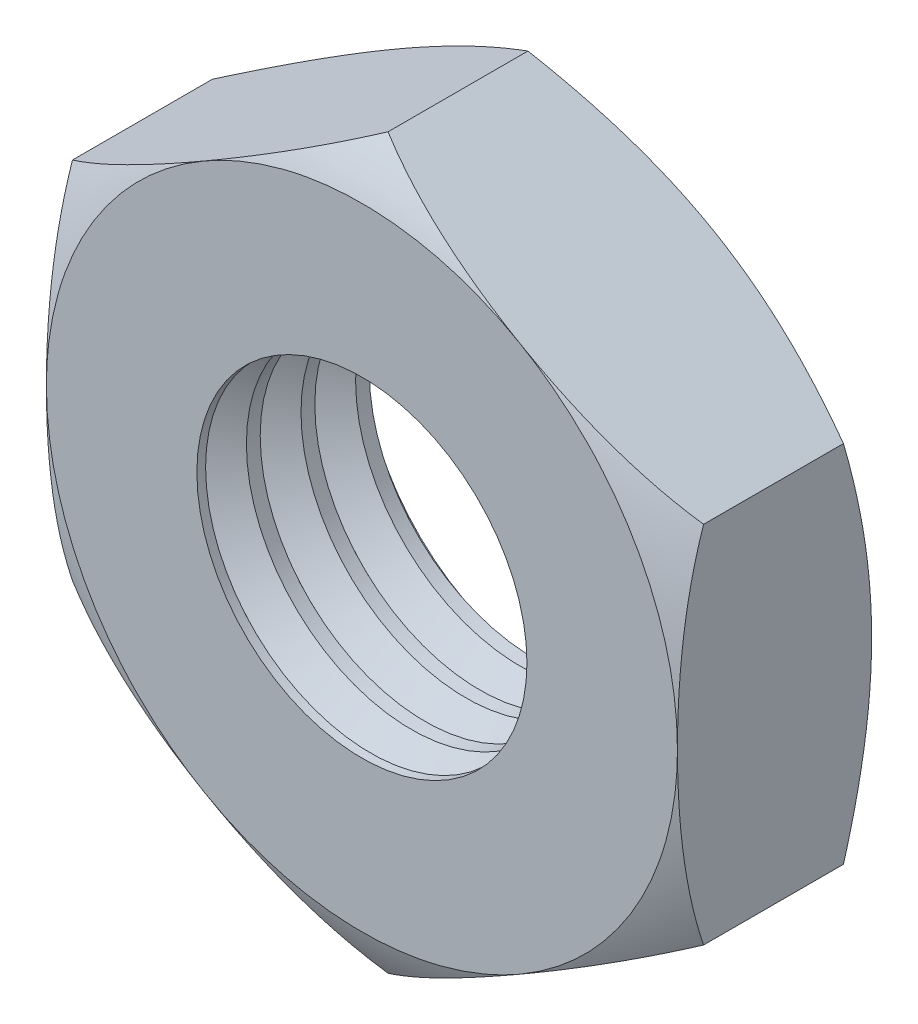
ISO-10303-21;
HEADER;
FILE_DESCRIPTION(('STEP AP214'),'2;1');
FILE_NAME('part.step','',(''),(''),'','','');
FILE_SCHEMA(('AUTOMOTIVE_DESIGN { 1 0 10303 214 1 1 1 1 }'));
ENDSEC;
DATA;
#1=APPLICATION_CONTEXT('core data for automotive mechanical design processes');
#2=APPLICATION_PROTOCOL_DEFINITION('international standard','automotive_design',2000,#1);
#3=PRODUCT_CONTEXT('',#1,'mechanical');
#4=PRODUCT('Part','Part','',(#3));
#5=PRODUCT_RELATED_PRODUCT_CATEGORY('part','',(#4));
#6=PRODUCT_DEFINITION_FORMATION('','',#4);
#7=PRODUCT_DEFINITION_CONTEXT('part definition',#1,'design');
#8=PRODUCT_DEFINITION('design','',#6,#7);
#9=PRODUCT_DEFINITION_SHAPE('','',#8);
#10=(LENGTH_UNIT() NAMED_UNIT(*) SI_UNIT(.MILLI.,.METRE.));
#11=(NAMED_UNIT(*) PLANE_ANGLE_UNIT() SI_UNIT($,.RADIAN.));
#12=(NAMED_UNIT(*) SI_UNIT($,.STERADIAN.) SOLID_ANGLE_UNIT());
#13=UNCERTAINTY_MEASURE_WITH_UNIT(LENGTH_MEASURE(1.E-05),#10,'distance_accuracy_value','');
#14=(GEOMETRIC_REPRESENTATION_CONTEXT(3) GLOBAL_UNCERTAINTY_ASSIGNED_CONTEXT((#13)) GLOBAL_UNIT_ASSIGNED_CONTEXT((#10,
#11,#12)) REPRESENTATION_CONTEXT('',''));
#15=CARTESIAN_POINT('',(0.,0.,0.));
#16=DIRECTION('',(0.,0.,1.));
#17=DIRECTION('',(1.,0.,0.));
#18=AXIS2_PLACEMENT_3D('',#15,#16,#17);
#19=CARTESIAN_POINT('',(0.,0.,-5.64973333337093));
#20=DIRECTION('',(0.,0.,1.));
#21=DIRECTION('',(1.,0.,0.));
#22=AXIS2_PLACEMENT_3D('',#19,#20,#21);
#23=CONICAL_SURFACE('',#22,3.99999999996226,0.959931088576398);
#24=CARTESIAN_POINT('',(0.,0.,-5.64973333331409));
#25=DIRECTION('',(0.,0.,-1.));
#26=DIRECTION('',(-1.,0.,0.));
#27=AXIS2_PLACEMENT_3D('',#24,#25,#26);
#28=CIRCLE('',#27,3.99999999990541);
#29=CARTESIAN_POINT('',(-3.99999999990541,0.,-5.64973333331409));
#30=VERTEX_POINT('',#29);
#31=EDGE_CURVE('E441',#30,#30,#28,.F.);
#32=ORIENTED_EDGE('',*,*,#31,.T.);
#33=EDGE_LOOP('',(#32));
#34=FACE_BOUND('',#33,.T.);
#35=CARTESIAN_POINT('',(0.,0.,-6.06985785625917));
#36=DIRECTION('',(0.,0.,1.));
#37=DIRECTION('',(1.,0.,0.));
#38=AXIS2_PLACEMENT_3D('',#35,#36,#37);
#39=CIRCLE('',#38,3.4);
#40=CARTESIAN_POINT('',(3.4,0.,-6.06985785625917));
#41=VERTEX_POINT('',#40);
#42=EDGE_CURVE('E439',#41,#41,#39,.F.);
#43=ORIENTED_EDGE('',*,*,#42,.T.);
#44=EDGE_LOOP('',(#43));
#45=FACE_BOUND('',#44,.T.);
#46=ADVANCED_FACE('F17',(#34,#45),#23,.F.);
#47=CARTESIAN_POINT('',(0.,0.,-5.6497333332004));
#48=DIRECTION('',(0.,0.,-1.));
#49=DIRECTION('',(-1.,0.,0.));
#50=AXIS2_PLACEMENT_3D('',#47,#48,#49);
#51=CONICAL_SURFACE('',#50,3.99999999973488,0.959931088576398);
#52=CARTESIAN_POINT('',(0.,0.,-5.22960881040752));
#53=DIRECTION('',(0.,0.,1.));
#54=DIRECTION('',(1.,0.,0.));
#55=AXIS2_PLACEMENT_3D('',#52,#53,#54);
#56=CIRCLE('',#55,3.4);
#57=CARTESIAN_POINT('',(3.4,0.,-5.22960881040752));
#58=VERTEX_POINT('',#57);
#59=EDGE_CURVE('E436',#58,#58,#56,.T.);
#60=ORIENTED_EDGE('',*,*,#59,.T.);
#61=EDGE_LOOP('',(#60));
#62=FACE_BOUND('',#61,.T.);
#63=ORIENTED_EDGE('',*,*,#31,.F.);
#64=EDGE_LOOP('',(#63));
#65=FACE_BOUND('',#64,.T.);
#66=ADVANCED_FACE('F447',(#62,#65),#51,.F.);
#67=CARTESIAN_POINT('',(0.,0.,-6.8));
#68=DIRECTION('',(0.,0.,1.));
#69=DIRECTION('',(1.,0.,0.));
#70=AXIS2_PLACEMENT_3D('',#67,#68,#69);
#71=CYLINDRICAL_SURFACE('',#70,3.4);
#72=ORIENTED_EDGE('',*,*,#42,.F.);
#73=EDGE_LOOP('',(#72));
#74=FACE_BOUND('',#73,.T.);
#75=CARTESIAN_POINT('',(0.,0.,-6.35447547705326));
#76=DIRECTION('',(0.,0.,-1.));
#77=DIRECTION('',(-1.,0.,0.));
#78=AXIS2_PLACEMENT_3D('',#75,#76,#77);
#79=CIRCLE('',#78,3.39999999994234);
#80=CARTESIAN_POINT('',(-3.39999999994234,0.,-6.35447547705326));
#81=VERTEX_POINT('',#80);
#82=EDGE_CURVE('E433',#81,#81,#79,.T.);
#83=ORIENTED_EDGE('',*,*,#82,.T.);
#84=EDGE_LOOP('',(#83));
#85=FACE_BOUND('',#84,.T.);
#86=ADVANCED_FACE('F449',(#74,#85),#71,.F.);
#87=CARTESIAN_POINT('',(0.,0.,-6.8));
#88=DIRECTION('',(0.,0.,1.));
#89=DIRECTION('',(1.,0.,0.));
#90=AXIS2_PLACEMENT_3D('',#87,#88,#89);
#91=CYLINDRICAL_SURFACE('',#90,3.4);
#92=ORIENTED_EDGE('',*,*,#59,.F.);
#93=EDGE_LOOP('',(#92));
#94=FACE_BOUND('',#93,.T.);
#95=CARTESIAN_POINT('',(0.,0.,-4.94499118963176));
#96=DIRECTION('',(0.,0.,1.));
#97=DIRECTION('',(1.,0.,0.));
#98=AXIS2_PLACEMENT_3D('',#95,#96,#97);
#99=CIRCLE('',#98,3.39999999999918);
#100=CARTESIAN_POINT('',(3.39999999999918,0.,-4.94499118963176));
#101=VERTEX_POINT('',#100);
#102=EDGE_CURVE('E430',#101,#101,#99,.T.);
#103=ORIENTED_EDGE('',*,*,#102,.T.);
#104=EDGE_LOOP('',(#103));
#105=FACE_BOUND('',#104,.T.);
#106=ADVANCED_FACE('F456',(#94,#105),#91,.F.);
#107=CARTESIAN_POINT('',(0.,0.,-6.7745999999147));
#108=DIRECTION('',(0.,0.,-1.));
#109=DIRECTION('',(-1.,0.,0.));
#110=AXIS2_PLACEMENT_3D('',#107,#108,#109);
#111=CONICAL_SURFACE('',#110,3.99999999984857,0.959931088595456);
#112=CARTESIAN_POINT('',(0.,0.,-6.7746));
#113=DIRECTION('',(0.,0.,1.));
#114=DIRECTION('',(1.,0.,0.));
#115=AXIS2_PLACEMENT_3D('',#112,#113,#114);
#116=CIRCLE('',#115,4.);
#117=CARTESIAN_POINT('',(4.,0.,-6.7746));
#118=VERTEX_POINT('',#117);
#119=EDGE_CURVE('E427',#118,#118,#116,.F.);
#120=ORIENTED_EDGE('',*,*,#119,.T.);
#121=EDGE_LOOP('',(#120));
#122=FACE_BOUND('',#121,.T.);
#123=ORIENTED_EDGE('',*,*,#82,.F.);
#124=EDGE_LOOP('',(#123));
#125=FACE_BOUND('',#124,.T.);
#126=ADVANCED_FACE('F462',(#122,#125),#111,.F.);
#127=CARTESIAN_POINT('',(0.,0.,-4.52486666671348));
#128=DIRECTION('',(0.,0.,1.));
#129=DIRECTION('',(1.,0.,0.));
#130=AXIS2_PLACEMENT_3D('',#127,#128,#129);
#131=CONICAL_SURFACE('',#130,3.99999999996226,0.959931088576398);
#132=ORIENTED_EDGE('',*,*,#102,.F.);
#133=EDGE_LOOP('',(#132));
#134=FACE_BOUND('',#133,.T.);
#135=CARTESIAN_POINT('',(0.,0.,-4.52486666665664));
#136=DIRECTION('',(0.,0.,-1.));
#137=DIRECTION('',(-1.,0.,0.));
#138=AXIS2_PLACEMENT_3D('',#135,#136,#137);
#139=CIRCLE('',#138,3.99999999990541);
#140=CARTESIAN_POINT('',(-3.99999999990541,0.,-4.52486666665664));
#141=VERTEX_POINT('',#140);
#142=EDGE_CURVE('E424',#141,#141,#139,.F.);
#143=ORIENTED_EDGE('',*,*,#142,.T.);
#144=EDGE_LOOP('',(#143));
#145=FACE_BOUND('',#144,.T.);
#146=ADVANCED_FACE('F466',(#134,#145),#131,.F.);
#147=CARTESIAN_POINT('',(0.,0.,-6.8));
#148=DIRECTION('',(0.,0.,1.));
#149=DIRECTION('',(1.,0.,0.));
#150=AXIS2_PLACEMENT_3D('',#147,#148,#149);
#151=CYLINDRICAL_SURFACE('',#150,4.);
#152=ORIENTED_EDGE('',*,*,#119,.F.);
#153=EDGE_LOOP('',(#152));
#154=FACE_BOUND('',#153,.T.);
#155=CARTESIAN_POINT('',(0.,0.,-6.8));
#156=DIRECTION('',(0.,0.,1.));
#157=DIRECTION('',(1.,0.,0.));
#158=AXIS2_PLACEMENT_3D('',#155,#156,#157);
#159=CIRCLE('',#158,4.);
#160=CARTESIAN_POINT('',(4.,0.,-6.8));
#161=VERTEX_POINT('',#160);
#162=EDGE_CURVE('E20',#161,#161,#159,.T.);
#163=ORIENTED_EDGE('',*,*,#162,.F.);
#164=EDGE_LOOP('',(#163));
#165=FACE_BOUND('',#164,.T.);
#166=ADVANCED_FACE('F470',(#154,#165),#151,.F.);
#167=CARTESIAN_POINT('',(0.,0.,-4.52486666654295));
#168=DIRECTION('',(0.,0.,-1.));
#169=DIRECTION('',(-1.,0.,0.));
#170=AXIS2_PLACEMENT_3D('',#167,#168,#169);
#171=CONICAL_SURFACE('',#170,3.99999999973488,0.959931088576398);
#172=CARTESIAN_POINT('',(0.,0.,-4.10474214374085));
#173=DIRECTION('',(0.,0.,1.));
#174=DIRECTION('',(1.,0.,0.));
#175=AXIS2_PLACEMENT_3D('',#172,#173,#174);
#176=CIRCLE('',#175,3.4);
#177=CARTESIAN_POINT('',(3.4,0.,-4.10474214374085));
#178=VERTEX_POINT('',#177);
#179=EDGE_CURVE('E114',#178,#178,#176,.T.);
#180=ORIENTED_EDGE('',*,*,#179,.T.);
#181=EDGE_LOOP('',(#180));
#182=FACE_BOUND('',#181,.T.);
#183=ORIENTED_EDGE('',*,*,#142,.F.);
#184=EDGE_LOOP('',(#183));
#185=FACE_BOUND('',#184,.T.);
#186=ADVANCED_FACE('F474',(#182,#185),#171,.F.);
#187=CARTESIAN_POINT('',(0.,7.50555349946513,-6.8));
#188=DIRECTION('',(0.,0.,-1.));
#189=DIRECTION('',(-1.,0.,0.));
#190=AXIS2_PLACEMENT_3D('',#187,#188,#189);
#191=PLANE('',#190);
#192=ORIENTED_EDGE('',*,*,#162,.T.);
#193=EDGE_LOOP('',(#192));
#194=FACE_BOUND('',#193,.T.);
#195=CARTESIAN_POINT('',(0.,0.,-6.80000000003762));
#196=DIRECTION('',(0.,0.,1.));
#197=DIRECTION('',(1.,0.,0.));
#198=AXIS2_PLACEMENT_3D('',#195,#196,#197);
#199=CIRCLE('',#198,6.49999999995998);
#200=CARTESIAN_POINT('',(3.24999999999,-5.62916512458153,-6.80000000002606));
#201=VERTEX_POINT('',#200);
#202=CARTESIAN_POINT('',(6.49999999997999,0.,-6.80000000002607));
#203=VERTEX_POINT('',#202);
#204=EDGE_CURVE('E760',#201,#203,#199,.T.);
#205=ORIENTED_EDGE('',*,*,#204,.F.);
#206=CARTESIAN_POINT('',(0.,0.,-6.80000000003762));
#207=DIRECTION('',(0.,0.,1.));
#208=DIRECTION('',(1.,0.,0.));
#209=AXIS2_PLACEMENT_3D('',#206,#207,#208);
#210=CIRCLE('',#209,6.49999999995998);
#211=CARTESIAN_POINT('',(-3.24999999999,-5.62916512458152,-6.80000000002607));
#212=VERTEX_POINT('',#211);
#213=EDGE_CURVE('E109',#212,#201,#210,.T.);
#214=ORIENTED_EDGE('',*,*,#213,.F.);
#215=CARTESIAN_POINT('',(0.,0.,-6.80000000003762));
#216=DIRECTION('',(0.,0.,1.));
#217=DIRECTION('',(1.,0.,0.));
#218=AXIS2_PLACEMENT_3D('',#215,#216,#217);
#219=CIRCLE('',#218,6.49999999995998);
#220=CARTESIAN_POINT('',(-6.49999999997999,0.,-6.80000000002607));
#221=VERTEX_POINT('',#220);
#222=EDGE_CURVE('E103',#221,#212,#219,.T.);
#223=ORIENTED_EDGE('',*,*,#222,.F.);
#224=CARTESIAN_POINT('',(0.,0.,-6.80000000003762));
#225=DIRECTION('',(0.,0.,1.));
#226=DIRECTION('',(1.,0.,0.));
#227=AXIS2_PLACEMENT_3D('',#224,#225,#226);
#228=CIRCLE('',#227,6.49999999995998);
#229=CARTESIAN_POINT('',(-3.24999999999,5.62916512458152,-6.80000000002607));
#230=VERTEX_POINT('',#229);
#231=EDGE_CURVE('E106',#230,#221,#228,.T.);
#232=ORIENTED_EDGE('',*,*,#231,.F.);
#233=CARTESIAN_POINT('',(0.,0.,-6.80000000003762));
#234=DIRECTION('',(0.,0.,1.));
#235=DIRECTION('',(1.,0.,0.));
#236=AXIS2_PLACEMENT_3D('',#233,#234,#235);
#237=CIRCLE('',#236,6.49999999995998);
#238=CARTESIAN_POINT('',(3.24999999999,5.62916512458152,-6.80000000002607));
#239=VERTEX_POINT('',#238);
#240=EDGE_CURVE('E125',#239,#230,#237,.T.);
#241=ORIENTED_EDGE('',*,*,#240,.F.);
#242=CARTESIAN_POINT('',(0.,0.,-6.80000000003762));
#243=DIRECTION('',(0.,0.,1.));
#244=DIRECTION('',(1.,0.,0.));
#245=AXIS2_PLACEMENT_3D('',#242,#243,#244);
#246=CIRCLE('',#245,6.49999999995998);
#247=EDGE_CURVE('E758',#203,#239,#246,.T.);
#248=ORIENTED_EDGE('',*,*,#247,.F.);
#249=EDGE_LOOP('',(#205,#214,#223,#232,#241,#248));
#250=FACE_BOUND('',#249,.T.);
#251=ADVANCED_FACE('F105',(#194,#250),#191,.T.);
#252=CARTESIAN_POINT('',(0.,0.,-6.8));
#253=DIRECTION('',(0.,0.,1.));
#254=DIRECTION('',(1.,0.,0.));
#255=AXIS2_PLACEMENT_3D('',#252,#253,#254);
#256=CYLINDRICAL_SURFACE('',#255,3.4);
#257=ORIENTED_EDGE('',*,*,#179,.F.);
#258=EDGE_LOOP('',(#257));
#259=FACE_BOUND('',#258,.T.);
#260=CARTESIAN_POINT('',(0.,0.,-3.82012452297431));
#261=DIRECTION('',(0.,0.,1.));
#262=DIRECTION('',(1.,0.,0.));
#263=AXIS2_PLACEMENT_3D('',#260,#261,#262);
#264=CIRCLE('',#263,3.39999999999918);
#265=CARTESIAN_POINT('',(3.39999999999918,0.,-3.82012452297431));
#266=VERTEX_POINT('',#265);
#267=EDGE_CURVE('E124',#266,#266,#264,.T.);
#268=ORIENTED_EDGE('',*,*,#267,.T.);
#269=EDGE_LOOP('',(#268));
#270=FACE_BOUND('',#269,.T.);
#271=ADVANCED_FACE('F481',(#259,#270),#256,.F.);
#272=CARTESIAN_POINT('',(0.,0.,-6.21596007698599));
#273=DIRECTION('',(0.,0.,1.));
#274=DIRECTION('',(1.,0.,0.));
#275=AXIS2_PLACEMENT_3D('',#272,#273,#274);
#276=CONICAL_SURFACE('',#275,7.51158682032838,1.04719755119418);
#277=CARTESIAN_POINT('',(-6.5,0.,-6.80000000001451));
#278=CARTESIAN_POINT('',(-6.5,-0.159284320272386,-6.8000265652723));
#279=CARTESIAN_POINT('',(-6.5,-0.318560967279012,-6.79662027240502));
#280=CARTESIAN_POINT('',(-6.5,-0.636801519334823,-6.78313941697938));
#281=CARTESIAN_POINT('',(-6.5,-0.795765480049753,-6.77306617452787));
#282=CARTESIAN_POINT('',(-6.5,-1.11235387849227,-6.74651519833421));
#283=CARTESIAN_POINT('',(-6.5,-1.26998104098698,-6.73006970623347));
#284=CARTESIAN_POINT('',(-6.5,-1.58448437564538,-6.69112797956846));
#285=CARTESIAN_POINT('',(-6.5,-1.74136052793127,-6.66863158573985));
#286=CARTESIAN_POINT('',(-6.5,-2.21021220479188,-6.5927610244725));
#287=CARTESIAN_POINT('',(-6.5,-2.52082569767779,-6.53096863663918));
#288=CARTESIAN_POINT('',(-6.5,-3.13938154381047,-6.38845958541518));
#289=CARTESIAN_POINT('',(-6.5,-3.44730232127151,-6.30764841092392));
#290=CARTESIAN_POINT('',(-6.5,-3.75277674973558,-6.21944341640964));
#291=B_SPLINE_CURVE_WITH_KNOTS('',3,(#277,#278,#279,#280,#281,#282,#283,#284,#285,#286,#287,
#288,#289,#290),.UNSPECIFIED.,.F.,.F.,(4,2,2,2,2,2,4),(0.,0.477804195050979,0.955513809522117,
1.43083727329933,1.9061732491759,2.85559935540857,3.80984701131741),.UNSPECIFIED.);
#292=CARTESIAN_POINT('',(-6.5000000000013,-3.75277674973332,-6.21944341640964));
#293=VERTEX_POINT('',#292);
#294=EDGE_CURVE('E127',#221,#293,#291,.T.);
#295=ORIENTED_EDGE('',*,*,#294,.F.);
#296=ORIENTED_EDGE('',*,*,#222,.T.);
#297=CARTESIAN_POINT('',(-6.5000000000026,-3.75277674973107,-6.21944341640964));
#298=CARTESIAN_POINT('',(-6.23545138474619,-3.9055139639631,-6.30764841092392));
#299=CARTESIAN_POINT('',(-5.96878416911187,-4.05947435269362,-6.38845958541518));
#300=CARTESIAN_POINT('',(-5.4330990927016,-4.36875227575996,-6.53096863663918));
#301=CARTESIAN_POINT('',(-5.16409991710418,-4.52405902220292,-6.5927610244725));
#302=CARTESIAN_POINT('',(-4.75806245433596,-4.75848486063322,-6.66863158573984));
#303=CARTESIAN_POINT('',(-4.62220372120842,-4.83692293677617,-6.69112797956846));
#304=CARTESIAN_POINT('',(-4.34983584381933,-4.99417460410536,-6.73006970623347));
#305=CARTESIAN_POINT('',(-4.21332671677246,-5.07298818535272,-6.74651519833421));
#306=CARTESIAN_POINT('',(-3.93915312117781,-5.23128238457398,-6.77306617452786));
#307=CARTESIAN_POINT('',(-3.80148629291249,-5.31076436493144,-6.78313941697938));
#308=CARTESIAN_POINT('',(-3.52588189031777,-5.46988464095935,-6.79662027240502));
#309=CARTESIAN_POINT('',(-3.38794426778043,-5.54952296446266,-6.8000265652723));
#310=CARTESIAN_POINT('',(-3.25000000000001,-5.62916512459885,-6.80000000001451));
#311=B_SPLINE_CURVE_WITH_KNOTS('',3,(#297,#298,#299,#300,#301,#302,#303,#304,#305,#306,#307,
#308,#309,#310),.UNSPECIFIED.,.F.,.F.,(4,2,2,2,2,2,4),(0.,0.954247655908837,1.90367376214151,
2.37900973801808,2.85433320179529,3.33204281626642,3.8098470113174),.UNSPECIFIED.);
#312=EDGE_CURVE('E130',#293,#212,#311,.T.);
#313=ORIENTED_EDGE('',*,*,#312,.F.);
#314=EDGE_LOOP('',(#295,#296,#313));
#315=FACE_BOUND('',#314,.T.);
#316=ADVANCED_FACE('F128',(#315),#276,.T.);
#317=CARTESIAN_POINT('',(0.,0.,-6.21596007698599));
#318=DIRECTION('',(0.,0.,1.));
#319=DIRECTION('',(1.,0.,0.));
#320=AXIS2_PLACEMENT_3D('',#317,#318,#319);
#321=CONICAL_SURFACE('',#320,7.51158682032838,1.04719755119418);
#322=CARTESIAN_POINT('',(-3.25,-5.62916512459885,-6.80000000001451));
#323=CARTESIAN_POINT('',(-3.11205573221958,-5.70880728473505,-6.8000265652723));
#324=CARTESIAN_POINT('',(-2.97411810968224,-5.78844560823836,-6.79662027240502));
#325=CARTESIAN_POINT('',(-2.69851370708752,-5.94756588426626,-6.78313941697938));
#326=CARTESIAN_POINT('',(-2.5608468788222,-6.02704786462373,-6.77306617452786));
#327=CARTESIAN_POINT('',(-2.28667328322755,-6.18534206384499,-6.74651519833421));
#328=CARTESIAN_POINT('',(-2.15016415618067,-6.26415564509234,-6.73006970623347));
#329=CARTESIAN_POINT('',(-1.87779627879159,-6.42140731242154,-6.69112797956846));
#330=CARTESIAN_POINT('',(-1.74193754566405,-6.49984538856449,-6.66863158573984));
#331=CARTESIAN_POINT('',(-1.33590008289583,-6.73427122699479,-6.5927610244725));
#332=CARTESIAN_POINT('',(-1.06690090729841,-6.88957797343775,-6.53096863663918));
#333=CARTESIAN_POINT('',(-0.531215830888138,-7.19885589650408,-6.38845958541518));
#334=CARTESIAN_POINT('',(-0.264548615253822,-7.3528162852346,-6.30764841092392));
#335=CARTESIAN_POINT('',(2.5960459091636E-12,-7.50555349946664,-6.21944341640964));
#336=B_SPLINE_CURVE_WITH_KNOTS('',3,(#322,#323,#324,#325,#326,#327,#328,#329,#330,#331,#332,
#333,#334,#335),.UNSPECIFIED.,.F.,.F.,(4,2,2,2,2,2,4),(0.,0.477804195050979,0.955513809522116,
1.43083727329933,1.9061732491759,2.85559935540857,3.80984701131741),.UNSPECIFIED.);
#337=CARTESIAN_POINT('',(0.,-7.50555349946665,-6.21944341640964));
#338=VERTEX_POINT('',#337);
#339=EDGE_CURVE('E418',#212,#338,#336,.T.);
#340=ORIENTED_EDGE('',*,*,#339,.F.);
#341=ORIENTED_EDGE('',*,*,#213,.T.);
#342=CARTESIAN_POINT('',(-2.60925158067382E-12,-7.50555349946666,-6.21944341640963));
#343=CARTESIAN_POINT('',(0.264548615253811,-7.35281628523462,-6.30764841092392));
#344=CARTESIAN_POINT('',(0.531215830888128,-7.1988558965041,-6.38845958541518));
#345=CARTESIAN_POINT('',(1.0669009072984,-6.88957797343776,-6.53096863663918));
#346=CARTESIAN_POINT('',(1.33590008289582,-6.7342712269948,-6.59276102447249));
#347=CARTESIAN_POINT('',(1.74193754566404,-6.4998453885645,-6.66863158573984));
#348=CARTESIAN_POINT('',(1.87779627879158,-6.42140731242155,-6.69112797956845));
#349=CARTESIAN_POINT('',(2.15016415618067,-6.26415564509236,-6.73006970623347));
#350=CARTESIAN_POINT('',(2.28667328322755,-6.185342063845,-6.7465151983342));
#351=CARTESIAN_POINT('',(2.5608468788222,-6.02704786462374,-6.77306617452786));
#352=CARTESIAN_POINT('',(2.69851370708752,-5.94756588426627,-6.78313941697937));
#353=CARTESIAN_POINT('',(2.97411810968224,-5.78844560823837,-6.79662027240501));
#354=CARTESIAN_POINT('',(3.11205573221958,-5.70880728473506,-6.80002656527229));
#355=CARTESIAN_POINT('',(3.25000000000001,-5.62916512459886,-6.80000000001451));
#356=B_SPLINE_CURVE_WITH_KNOTS('',3,(#342,#343,#344,#345,#346,#347,#348,#349,#350,#351,#352,
#353,#354,#355),.UNSPECIFIED.,.F.,.F.,(4,2,2,2,2,2,4),(0.,0.954247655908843,1.90367376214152,
2.37900973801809,2.8543332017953,3.33204281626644,3.80984701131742),.UNSPECIFIED.);
#357=EDGE_CURVE('E363',#338,#201,#356,.T.);
#358=ORIENTED_EDGE('',*,*,#357,.F.);
#359=EDGE_LOOP('',(#340,#341,#358));
#360=FACE_BOUND('',#359,.T.);
#361=ADVANCED_FACE('F379',(#360),#321,.T.);
#362=CARTESIAN_POINT('',(0.,0.,-6.21596007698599));
#363=DIRECTION('',(0.,0.,1.));
#364=DIRECTION('',(1.,0.,0.));
#365=AXIS2_PLACEMENT_3D('',#362,#363,#364);
#366=CONICAL_SURFACE('',#365,7.51158682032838,1.04719755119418);
#367=ORIENTED_EDGE('',*,*,#204,.T.);
#368=CARTESIAN_POINT('',(6.5,0.,-6.80000000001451));
#369=CARTESIAN_POINT('',(6.5,-0.159284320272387,-6.8000265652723));
#370=CARTESIAN_POINT('',(6.5,-0.318560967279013,-6.79662027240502));
#371=CARTESIAN_POINT('',(6.5,-0.636801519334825,-6.78313941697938));
#372=CARTESIAN_POINT('',(6.5,-0.795765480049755,-6.77306617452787));
#373=CARTESIAN_POINT('',(6.5,-1.11235387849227,-6.74651519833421));
#374=CARTESIAN_POINT('',(6.5,-1.26998104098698,-6.73006970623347));
#375=CARTESIAN_POINT('',(6.5,-1.58448437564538,-6.69112797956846));
#376=CARTESIAN_POINT('',(6.5,-1.74136052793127,-6.66863158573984));
#377=CARTESIAN_POINT('',(6.5,-2.21021220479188,-6.5927610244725));
#378=CARTESIAN_POINT('',(6.5,-2.5208256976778,-6.53096863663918));
#379=CARTESIAN_POINT('',(6.5,-3.13938154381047,-6.38845958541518));
#380=CARTESIAN_POINT('',(6.5,-3.44730232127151,-6.30764841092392));
#381=CARTESIAN_POINT('',(6.5,-3.75277674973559,-6.21944341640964));
#382=B_SPLINE_CURVE_WITH_KNOTS('',3,(#368,#369,#370,#371,#372,#373,#374,#375,#376,#377,#378,
#379,#380,#381),.UNSPECIFIED.,.F.,.F.,(4,2,2,2,2,2,4),(0.,0.47780419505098,0.955513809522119,
1.43083727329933,1.90617324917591,2.85559935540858,3.80984701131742),.UNSPECIFIED.);
#383=CARTESIAN_POINT('',(6.5000000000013,-3.75277674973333,-6.21944341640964));
#384=VERTEX_POINT('',#383);
#385=EDGE_CURVE('E384',#203,#384,#382,.T.);
#386=ORIENTED_EDGE('',*,*,#385,.T.);
#387=CARTESIAN_POINT('',(3.25000000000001,-5.62916512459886,-6.80000000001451));
#388=CARTESIAN_POINT('',(3.38794426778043,-5.54952296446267,-6.8000265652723));
#389=CARTESIAN_POINT('',(3.52588189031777,-5.46988464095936,-6.79662027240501));
#390=CARTESIAN_POINT('',(3.80148629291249,-5.31076436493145,-6.78313941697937));
#391=CARTESIAN_POINT('',(3.93915312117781,-5.23128238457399,-6.77306617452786));
#392=CARTESIAN_POINT('',(4.21332671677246,-5.07298818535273,-6.7465151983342));
#393=CARTESIAN_POINT('',(4.34983584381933,-4.99417460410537,-6.73006970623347));
#394=CARTESIAN_POINT('',(4.62220372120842,-4.83692293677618,-6.69112797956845));
#395=CARTESIAN_POINT('',(4.75806245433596,-4.75848486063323,-6.66863158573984));
#396=CARTESIAN_POINT('',(5.16409991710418,-4.52405902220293,-6.59276102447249));
#397=CARTESIAN_POINT('',(5.4330990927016,-4.36875227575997,-6.53096863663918));
#398=CARTESIAN_POINT('',(5.96878416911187,-4.05947435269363,-6.38845958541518));
#399=CARTESIAN_POINT('',(6.23545138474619,-3.90551396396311,-6.30764841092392));
#400=CARTESIAN_POINT('',(6.5000000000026,-3.75277674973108,-6.21944341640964));
#401=B_SPLINE_CURVE_WITH_KNOTS('',3,(#387,#388,#389,#390,#391,#392,#393,#394,#395,#396,#397,
#398,#399,#400),.UNSPECIFIED.,.F.,.F.,(4,2,2,2,2,2,4),(0.,0.477804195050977,0.955513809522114,
1.43083727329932,1.90617324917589,2.85559935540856,3.8098470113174),.UNSPECIFIED.);
#402=EDGE_CURVE('E354',#201,#384,#401,.T.);
#403=ORIENTED_EDGE('',*,*,#402,.F.);
#404=EDGE_LOOP('',(#367,#386,#403));
#405=FACE_BOUND('',#404,.T.);
#406=ADVANCED_FACE('F375',(#405),#366,.T.);
#407=CARTESIAN_POINT('',(0.,0.,-6.21596007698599));
#408=DIRECTION('',(0.,0.,1.));
#409=DIRECTION('',(1.,0.,0.));
#410=AXIS2_PLACEMENT_3D('',#407,#408,#409);
#411=CONICAL_SURFACE('',#410,7.51158682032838,1.04719755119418);
#412=CARTESIAN_POINT('',(6.5,3.75277674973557,-6.21944341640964));
#413=CARTESIAN_POINT('',(6.5,3.4473023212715,-6.30764841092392));
#414=CARTESIAN_POINT('',(6.5,3.13938154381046,-6.38845958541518));
#415=CARTESIAN_POINT('',(6.5,2.52082569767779,-6.53096863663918));
#416=CARTESIAN_POINT('',(6.5,2.21021220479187,-6.5927610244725));
#417=CARTESIAN_POINT('',(6.5,1.74136052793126,-6.66863158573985));
#418=CARTESIAN_POINT('',(6.5,1.58448437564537,-6.69112797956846));
#419=CARTESIAN_POINT('',(6.5,1.26998104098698,-6.73006970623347));
#420=CARTESIAN_POINT('',(6.5,1.11235387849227,-6.74651519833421));
#421=CARTESIAN_POINT('',(6.5,0.795765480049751,-6.77306617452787));
#422=CARTESIAN_POINT('',(6.5,0.636801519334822,-6.78313941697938));
#423=CARTESIAN_POINT('',(6.5,0.318560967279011,-6.79662027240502));
#424=CARTESIAN_POINT('',(6.5,0.159284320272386,-6.8000265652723));
#425=CARTESIAN_POINT('',(6.5,0.,-6.80000000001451));
#426=B_SPLINE_CURVE_WITH_KNOTS('',3,(#412,#413,#414,#415,#416,#417,#418,#419,#420,#421,#422,
#423,#424,#425),.UNSPECIFIED.,.F.,.F.,(4,2,2,2,2,2,4),(0.,0.95424765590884,1.90367376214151,
2.37900973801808,2.85433320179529,3.33204281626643,3.80984701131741),.UNSPECIFIED.);
#427=CARTESIAN_POINT('',(6.5000000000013,3.75277674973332,-6.21944341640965));
#428=VERTEX_POINT('',#427);
#429=EDGE_CURVE('E362',#428,#203,#426,.T.);
#430=ORIENTED_EDGE('',*,*,#429,.T.);
#431=ORIENTED_EDGE('',*,*,#247,.T.);
#432=CARTESIAN_POINT('',(6.5000000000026,3.75277674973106,-6.21944341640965));
#433=CARTESIAN_POINT('',(6.23545138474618,3.9055139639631,-6.30764841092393));
#434=CARTESIAN_POINT('',(5.96878416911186,4.05947435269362,-6.38845958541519));
#435=CARTESIAN_POINT('',(5.43309909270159,4.36875227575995,-6.53096863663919));
#436=CARTESIAN_POINT('',(5.16409991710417,4.52405902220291,-6.5927610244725));
#437=CARTESIAN_POINT('',(4.75806245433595,4.75848486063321,-6.66863158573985));
#438=CARTESIAN_POINT('',(4.62220372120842,4.83692293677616,-6.69112797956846));
#439=CARTESIAN_POINT('',(4.34983584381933,4.99417460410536,-6.73006970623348));
#440=CARTESIAN_POINT('',(4.21332671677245,5.07298818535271,-6.74651519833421));
#441=CARTESIAN_POINT('',(3.9391531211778,5.23128238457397,-6.77306617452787));
#442=CARTESIAN_POINT('',(3.80148629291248,5.31076436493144,-6.78313941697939));
#443=CARTESIAN_POINT('',(3.52588189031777,5.46988464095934,-6.79662027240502));
#444=CARTESIAN_POINT('',(3.38794426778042,5.54952296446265,-6.80002656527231));
#445=CARTESIAN_POINT('',(3.25,5.62916512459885,-6.80000000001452));
#446=B_SPLINE_CURVE_WITH_KNOTS('',3,(#432,#433,#434,#435,#436,#437,#438,#439,#440,#441,#442,
#443,#444,#445),.UNSPECIFIED.,.F.,.F.,(4,2,2,2,2,2,4),(0.,0.954247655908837,1.90367376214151,
2.37900973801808,2.85433320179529,3.33204281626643,3.8098470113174),.UNSPECIFIED.);
#447=EDGE_CURVE('E391',#428,#239,#446,.T.);
#448=ORIENTED_EDGE('',*,*,#447,.F.);
#449=EDGE_LOOP('',(#430,#431,#448));
#450=FACE_BOUND('',#449,.T.);
#451=ADVANCED_FACE('F378',(#450),#411,.T.);
#452=CARTESIAN_POINT('',(0.,0.,-6.21596007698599));
#453=DIRECTION('',(0.,0.,1.));
#454=DIRECTION('',(1.,0.,0.));
#455=AXIS2_PLACEMENT_3D('',#452,#453,#454);
#456=CONICAL_SURFACE('',#455,7.51158682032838,1.04719755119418);
#457=CARTESIAN_POINT('',(3.25,5.62916512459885,-6.80000000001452));
#458=CARTESIAN_POINT('',(3.11205573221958,5.70880728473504,-6.80002656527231));
#459=CARTESIAN_POINT('',(2.97411810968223,5.78844560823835,-6.79662027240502));
#460=CARTESIAN_POINT('',(2.69851370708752,5.94756588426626,-6.78313941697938));
#461=CARTESIAN_POINT('',(2.5608468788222,6.02704786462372,-6.77306617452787));
#462=CARTESIAN_POINT('',(2.28667328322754,6.18534206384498,-6.74651519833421));
#463=CARTESIAN_POINT('',(2.15016415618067,6.26415564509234,-6.73006970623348));
#464=CARTESIAN_POINT('',(1.87779627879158,6.42140731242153,-6.69112797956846));
#465=CARTESIAN_POINT('',(1.74193754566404,6.49984538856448,-6.66863158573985));
#466=CARTESIAN_POINT('',(1.33590008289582,6.73427122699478,-6.5927610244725));
#467=CARTESIAN_POINT('',(1.0669009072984,6.88957797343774,-6.53096863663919));
#468=CARTESIAN_POINT('',(0.53121583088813,7.19885589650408,-6.38845958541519));
#469=CARTESIAN_POINT('',(0.264548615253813,7.3528162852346,-6.30764841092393));
#470=CARTESIAN_POINT('',(-2.60505652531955E-12,7.50555349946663,-6.21944341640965));
#471=B_SPLINE_CURVE_WITH_KNOTS('',3,(#457,#458,#459,#460,#461,#462,#463,#464,#465,#466,#467,
#468,#469,#470),.UNSPECIFIED.,.F.,.F.,(4,2,2,2,2,2,4),(0.,0.477804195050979,0.955513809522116,
1.43083727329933,1.9061732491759,2.85559935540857,3.80984701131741),.UNSPECIFIED.);
#472=CARTESIAN_POINT('',(0.,7.50555349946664,-6.21944341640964));
#473=VERTEX_POINT('',#472);
#474=EDGE_CURVE('E397',#239,#473,#471,.T.);
#475=ORIENTED_EDGE('',*,*,#474,.F.);
#476=ORIENTED_EDGE('',*,*,#240,.T.);
#477=CARTESIAN_POINT('',(2.60317716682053E-12,7.50555349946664,-6.21944341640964));
#478=CARTESIAN_POINT('',(-0.264548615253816,7.35281628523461,-6.30764841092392));
#479=CARTESIAN_POINT('',(-0.531215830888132,7.19885589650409,-6.38845958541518));
#480=CARTESIAN_POINT('',(-1.06690090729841,6.88957797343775,-6.53096863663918));
#481=CARTESIAN_POINT('',(-1.33590008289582,6.73427122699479,-6.5927610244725));
#482=CARTESIAN_POINT('',(-1.74193754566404,6.49984538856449,-6.66863158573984));
#483=CARTESIAN_POINT('',(-1.87779627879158,6.42140731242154,-6.69112797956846));
#484=CARTESIAN_POINT('',(-2.15016415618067,6.26415564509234,-6.73006970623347));
#485=CARTESIAN_POINT('',(-2.28667328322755,6.18534206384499,-6.74651519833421));
#486=CARTESIAN_POINT('',(-2.5608468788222,6.02704786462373,-6.77306617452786));
#487=CARTESIAN_POINT('',(-2.69851370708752,5.94756588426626,-6.78313941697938));
#488=CARTESIAN_POINT('',(-2.97411810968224,5.78844560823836,-6.79662027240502));
#489=CARTESIAN_POINT('',(-3.11205573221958,5.70880728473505,-6.8000265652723));
#490=CARTESIAN_POINT('',(-3.25,5.62916512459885,-6.80000000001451));
#491=B_SPLINE_CURVE_WITH_KNOTS('',3,(#477,#478,#479,#480,#481,#482,#483,#484,#485,#486,#487,
#488,#489,#490),.UNSPECIFIED.,.F.,.F.,(4,2,2,2,2,2,4),(0.,0.95424765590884,1.90367376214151,
2.37900973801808,2.85433320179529,3.33204281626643,3.80984701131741),.UNSPECIFIED.);
#492=EDGE_CURVE('E174',#473,#230,#491,.T.);
#493=ORIENTED_EDGE('',*,*,#492,.F.);
#494=EDGE_LOOP('',(#475,#476,#493));
#495=FACE_BOUND('',#494,.T.);
#496=ADVANCED_FACE('F161',(#495),#456,.T.);
#497=CARTESIAN_POINT('',(0.,0.,-6.21596007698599));
#498=DIRECTION('',(0.,0.,1.));
#499=DIRECTION('',(1.,0.,0.));
#500=AXIS2_PLACEMENT_3D('',#497,#498,#499);
#501=CONICAL_SURFACE('',#500,7.51158682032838,1.04719755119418);
#502=ORIENTED_EDGE('',*,*,#231,.T.);
#503=CARTESIAN_POINT('',(-6.5,3.75277674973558,-6.21944341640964));
#504=CARTESIAN_POINT('',(-6.5,3.44730232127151,-6.30764841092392));
#505=CARTESIAN_POINT('',(-6.5,3.13938154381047,-6.38845958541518));
#506=CARTESIAN_POINT('',(-6.5,2.52082569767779,-6.53096863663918));
#507=CARTESIAN_POINT('',(-6.5,2.21021220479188,-6.5927610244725));
#508=CARTESIAN_POINT('',(-6.5,1.74136052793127,-6.66863158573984));
#509=CARTESIAN_POINT('',(-6.5,1.58448437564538,-6.69112797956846));
#510=CARTESIAN_POINT('',(-6.5,1.26998104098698,-6.73006970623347));
#511=CARTESIAN_POINT('',(-6.5,1.11235387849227,-6.74651519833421));
#512=CARTESIAN_POINT('',(-6.5,0.795765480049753,-6.77306617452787));
#513=CARTESIAN_POINT('',(-6.5,0.636801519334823,-6.78313941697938));
#514=CARTESIAN_POINT('',(-6.5,0.318560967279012,-6.79662027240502));
#515=CARTESIAN_POINT('',(-6.5,0.159284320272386,-6.8000265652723));
#516=CARTESIAN_POINT('',(-6.5,0.,-6.80000000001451));
#517=B_SPLINE_CURVE_WITH_KNOTS('',3,(#503,#504,#505,#506,#507,#508,#509,#510,#511,#512,#513,
#514,#515,#516),.UNSPECIFIED.,.F.,.F.,(4,2,2,2,2,2,4),(0.,0.954247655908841,1.90367376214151,
2.37900973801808,2.8543332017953,3.33204281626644,3.80984701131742),.UNSPECIFIED.);
#518=CARTESIAN_POINT('',(-6.5,3.75277674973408,-6.21944341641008));
#519=VERTEX_POINT('',#518);
#520=EDGE_CURVE('E119',#519,#221,#517,.T.);
#521=ORIENTED_EDGE('',*,*,#520,.F.);
#522=CARTESIAN_POINT('',(-3.25,5.62916512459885,-6.80000000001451));
#523=CARTESIAN_POINT('',(-3.38794426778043,5.54952296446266,-6.8000265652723));
#524=CARTESIAN_POINT('',(-3.52588189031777,5.46988464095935,-6.79662027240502));
#525=CARTESIAN_POINT('',(-3.80148629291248,5.31076436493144,-6.78313941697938));
#526=CARTESIAN_POINT('',(-3.9391531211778,5.23128238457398,-6.77306617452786));
#527=CARTESIAN_POINT('',(-4.21332671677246,5.07298818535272,-6.74651519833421));
#528=CARTESIAN_POINT('',(-4.34983584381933,4.99417460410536,-6.73006970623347));
#529=CARTESIAN_POINT('',(-4.62220372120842,4.83692293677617,-6.69112797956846));
#530=CARTESIAN_POINT('',(-4.75806245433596,4.75848486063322,-6.66863158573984));
#531=CARTESIAN_POINT('',(-5.16409991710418,4.52405902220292,-6.5927610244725));
#532=CARTESIAN_POINT('',(-5.4330990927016,4.36875227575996,-6.53096863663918));
#533=CARTESIAN_POINT('',(-5.96878416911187,4.05947435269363,-6.38845958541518));
#534=CARTESIAN_POINT('',(-6.23545138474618,3.90551396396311,-6.30764841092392));
#535=CARTESIAN_POINT('',(-6.5000000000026,3.75277674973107,-6.21944341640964));
#536=B_SPLINE_CURVE_WITH_KNOTS('',3,(#522,#523,#524,#525,#526,#527,#528,#529,#530,#531,#532,
#533,#534,#535),.UNSPECIFIED.,.F.,.F.,(4,2,2,2,2,2,4),(0.,0.477804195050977,0.955513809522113,
1.43083727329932,1.9061732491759,2.85559935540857,3.8098470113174),.UNSPECIFIED.);
#537=EDGE_CURVE('E122',#230,#519,#536,.T.);
#538=ORIENTED_EDGE('',*,*,#537,.F.);
#539=EDGE_LOOP('',(#502,#521,#538));
#540=FACE_BOUND('',#539,.T.);
#541=ADVANCED_FACE('F117',(#540),#501,.T.);
#542=CARTESIAN_POINT('',(0.,0.,-3.40000000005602));
#543=DIRECTION('',(0.,0.,1.));
#544=DIRECTION('',(0.,-1.,0.));
#545=AXIS2_PLACEMENT_3D('',#542,#543,#544);
#546=CONICAL_SURFACE('',#545,3.99999999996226,0.959931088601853);
#547=ORIENTED_EDGE('',*,*,#267,.F.);
#548=EDGE_LOOP('',(#547));
#549=FACE_BOUND('',#548,.T.);
#550=CARTESIAN_POINT('',(0.,0.,-3.39999999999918));
#551=DIRECTION('',(0.,0.,-1.));
#552=DIRECTION('',(-1.,0.,0.));
#553=AXIS2_PLACEMENT_3D('',#550,#551,#552);
#554=CIRCLE('',#553,3.99999999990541);
#555=CARTESIAN_POINT('',(-3.99999999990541,0.,-3.39999999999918));
#556=VERTEX_POINT('',#555);
#557=EDGE_CURVE('E173',#556,#556,#554,.F.);
#558=ORIENTED_EDGE('',*,*,#557,.T.);
#559=EDGE_LOOP('',(#558));
#560=FACE_BOUND('',#559,.T.);
#561=ADVANCED_FACE('F160',(#549,#560),#546,.F.);
#562=CARTESIAN_POINT('',(-6.5,3.75277674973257,-6.8));
#563=DIRECTION('',(-1.,0.,0.));
#564=DIRECTION('',(0.,0.,1.));
#565=AXIS2_PLACEMENT_3D('',#562,#563,#564);
#566=PLANE('',#565);
#567=ORIENTED_EDGE('',*,*,#520,.T.);
#568=ORIENTED_EDGE('',*,*,#294,.T.);
#569=DIRECTION('',(0.,0.,1.));
#570=VECTOR('',#569,1.);
#571=CARTESIAN_POINT('',(-6.49999999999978,-3.7527767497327,-6.8));
#572=LINE('',#571,#570);
#573=CARTESIAN_POINT('',(-6.49999999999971,-3.75277674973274,-3.33775085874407));
#574=VERTEX_POINT('',#573);
#575=EDGE_CURVE('E133',#574,#293,#572,.F.);
#576=ORIENTED_EDGE('',*,*,#575,.F.);
#577=CARTESIAN_POINT('',(-6.5,0.,-2.8));
#578=CARTESIAN_POINT('',(-6.5,-0.10224964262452,-2.80000503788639));
#579=CARTESIAN_POINT('',(-6.5,-0.204496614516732,-2.80097174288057));
#580=CARTESIAN_POINT('',(-6.5,-0.408957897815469,-2.80487099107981));
#581=CARTESIAN_POINT('',(-6.5,-0.511172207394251,-2.80780362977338));
#582=CARTESIAN_POINT('',(-6.5,-0.817887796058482,-2.81962091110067));
#583=CARTESIAN_POINT('',(-6.5,-1.02228395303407,-2.83152506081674));
#584=CARTESIAN_POINT('',(-6.5,-1.43051871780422,-2.8642177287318));
#585=CARTESIAN_POINT('',(-6.5,-1.63435682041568,-2.88501261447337));
#586=CARTESIAN_POINT('',(-6.5,-2.04070147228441,-2.93674294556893));
#587=CARTESIAN_POINT('',(-6.5,-2.24320851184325,-2.96767441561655));
#588=CARTESIAN_POINT('',(-6.5,-2.55514268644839,-3.02454029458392));
#589=CARTESIAN_POINT('',(-6.5,-2.66531568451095,-3.04642588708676));
#590=CARTESIAN_POINT('',(-6.5,-2.88485332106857,-3.09391310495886));
#591=CARTESIAN_POINT('',(-6.5,-2.99421802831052,-3.11951441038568));
#592=CARTESIAN_POINT('',(-6.5,-3.21247403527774,-3.1747816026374));
#593=CARTESIAN_POINT('',(-6.5,-3.32136058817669,-3.20446629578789));
#594=CARTESIAN_POINT('',(-6.5,-3.53799341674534,-3.26797145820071));
#595=CARTESIAN_POINT('',(-6.5,-3.64573893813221,-3.30179449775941));
#596=CARTESIAN_POINT('',(-6.5,-3.75277674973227,-3.33775085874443));
#597=B_SPLINE_CURVE_WITH_KNOTS('',3,(#577,#578,#579,#580,#581,#582,#583,#584,#585,#586,#587,
#588,#589,#590,#591,#592,#593,#594,#595,#596),.UNSPECIFIED.,.F.,.F.,(4,2,2,2,2,2,2,2,2,4),(0.,
0.306738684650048,0.613492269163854,1.22753242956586,1.84201310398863,2.45625308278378,
2.79317603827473,3.13007000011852,3.46857101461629,3.80728334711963),.UNSPECIFIED.);
#598=CARTESIAN_POINT('',(-6.5,0.,-2.8));
#599=VERTEX_POINT('',#598);
#600=EDGE_CURVE('E510',#599,#574,#597,.T.);
#601=ORIENTED_EDGE('',*,*,#600,.F.);
#602=CARTESIAN_POINT('',(-6.5,3.75277674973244,-3.33775085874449));
#603=CARTESIAN_POINT('',(-6.5,3.65617326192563,-3.30530523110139));
#604=CARTESIAN_POINT('',(-6.5,3.5589991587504,-3.27459218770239));
#605=CARTESIAN_POINT('',(-6.5,3.36370340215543,-3.21654830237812));
#606=CARTESIAN_POINT('',(-6.5,3.26558229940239,-3.18921560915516));
#607=CARTESIAN_POINT('',(-6.5,2.96960162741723,-3.11202797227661));
#608=CARTESIAN_POINT('',(-6.5,2.77044565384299,-3.06709031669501));
#609=CARTESIAN_POINT('',(-6.5,2.36980349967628,-2.98901814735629));
#610=CARTESIAN_POINT('',(-6.5,2.16831647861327,-2.95588803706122));
#611=CARTESIAN_POINT('',(-6.5,1.8031429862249,-2.90541988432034));
#612=CARTESIAN_POINT('',(-6.5,1.63970192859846,-2.88626538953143));
#613=CARTESIAN_POINT('',(-6.5,1.31225369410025,-2.85400731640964));
#614=CARTESIAN_POINT('',(-6.5,1.14824660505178,-2.84090283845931));
#615=CARTESIAN_POINT('',(-6.5,0.820269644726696,-2.82019696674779));
#616=CARTESIAN_POINT('',(-6.5,0.656300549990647,-2.81258302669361));
#617=CARTESIAN_POINT('',(-6.5,0.328217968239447,-2.80250557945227));
#618=CARTESIAN_POINT('',(-6.5,0.164104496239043,-2.80004158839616));
#619=CARTESIAN_POINT('',(-6.5,0.,-2.8));
#620=B_SPLINE_CURVE_WITH_KNOTS('',3,(#602,#603,#604,#605,#606,#607,#608,#609,#610,#611,#612,
#613,#614,#615,#616,#617,#618,#619),.UNSPECIFIED.,.F.,.F.,(4,2,2,2,2,2,2,2,4),(0.,
0.305684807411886,0.611201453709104,1.22324744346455,1.83552144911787,2.32908174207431,
2.82256862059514,3.31492423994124,3.8072335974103),.UNSPECIFIED.);
#621=CARTESIAN_POINT('',(-6.5,3.7527767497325,-3.33775085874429));
#622=VERTEX_POINT('',#621);
#623=EDGE_CURVE('E175',#622,#599,#620,.T.);
#624=ORIENTED_EDGE('',*,*,#623,.F.);
#625=DIRECTION('',(0.,0.,1.));
#626=VECTOR('',#625,1.);
#627=CARTESIAN_POINT('',(-6.5,3.75277674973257,-6.8));
#628=LINE('',#627,#626);
#629=EDGE_CURVE('E137',#519,#622,#628,.T.);
#630=ORIENTED_EDGE('',*,*,#629,.F.);
#631=EDGE_LOOP('',(#567,#568,#576,#601,#624,#630));
#632=FACE_BOUND('',#631,.T.);
#633=ADVANCED_FACE('F135',(#632),#566,.T.);
#634=CARTESIAN_POINT('',(-6.5,-3.75277674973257,-6.8));
#635=DIRECTION('',(-0.5,-0.866025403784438,0.));
#636=DIRECTION('',(0.866025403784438,-0.5,0.));
#637=AXIS2_PLACEMENT_3D('',#634,#635,#636);
#638=PLANE('',#637);
#639=ORIENTED_EDGE('',*,*,#312,.T.);
#640=ORIENTED_EDGE('',*,*,#339,.T.);
#641=DIRECTION('',(0.,0.,1.));
#642=VECTOR('',#641,1.);
#643=CARTESIAN_POINT('',(0.,-7.50555349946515,-6.8));
#644=LINE('',#643,#642);
#645=CARTESIAN_POINT('',(0.,-7.50555349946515,-3.33775085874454));
#646=VERTEX_POINT('',#645);
#647=EDGE_CURVE('E415',#646,#338,#644,.F.);
#648=ORIENTED_EDGE('',*,*,#647,.F.);
#649=CARTESIAN_POINT('',(-3.25,-5.62916512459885,-2.8));
#650=CARTESIAN_POINT('',(-3.16144921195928,-5.68028994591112,-2.80000503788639));
#651=CARTESIAN_POINT('',(-3.07290073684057,-5.73141343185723,-2.80097174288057));
#652=CARTESIAN_POINT('',(-2.89583207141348,-5.83364407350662,-2.80487099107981));
#653=CARTESIAN_POINT('',(-2.80731188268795,-5.88475122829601,-2.80780362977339));
#654=CARTESIAN_POINT('',(-2.54168839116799,-6.03810902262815,-2.81962091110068));
#655=CARTESIAN_POINT('',(-2.36467612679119,-6.14030710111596,-2.83152506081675));
#656=CARTESIAN_POINT('',(-2.01113444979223,-6.34442448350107,-2.86421772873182));
#657=CARTESIAN_POINT('',(-1.83460547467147,-6.44634353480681,-2.8850126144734));
#658=CARTESIAN_POINT('',(-1.48270068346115,-6.6495158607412,-2.93674294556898));
#659=CARTESIAN_POINT('',(-1.30732444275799,-6.75076938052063,-2.9676744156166));
#660=CARTESIAN_POINT('',(-1.03718152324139,-6.90673646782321,-3.02454029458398));
#661=CARTESIAN_POINT('',(-0.941768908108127,-6.96182296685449,-3.04642588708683));
#662=CARTESIAN_POINT('',(-0.75164373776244,-7.0715917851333,-3.09391310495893));
#663=CARTESIAN_POINT('',(-0.656931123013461,-7.12627413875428,-3.11951441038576));
#664=CARTESIAN_POINT('',(-0.467915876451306,-7.23540214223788,-3.17478160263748));
#665=CARTESIAN_POINT('',(-0.373617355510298,-7.28984541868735,-3.20446629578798));
#666=CARTESIAN_POINT('',(-0.186007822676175,-7.39816183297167,-3.2679714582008));
#667=CARTESIAN_POINT('',(-0.0926974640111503,-7.45203459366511,-3.30179449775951));
#668=CARTESIAN_POINT('',(0.,-7.50555349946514,-3.33775085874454));
#669=B_SPLINE_CURVE_WITH_KNOTS('',3,(#649,#650,#651,#652,#653,#654,#655,#656,#657,#658,#659,
#660,#661,#662,#663,#664,#665,#666,#667,#668),.UNSPECIFIED.,.F.,.F.,(4,2,2,2,2,2,2,2,2,4),(0.,
0.30673868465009,0.613492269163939,1.22753242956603,1.84201310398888,2.45625308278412,
2.79317603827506,3.13007000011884,3.46857101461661,3.80728334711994),.UNSPECIFIED.);
#670=CARTESIAN_POINT('',(-3.25,-5.62916512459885,-2.8));
#671=VERTEX_POINT('',#670);
#672=EDGE_CURVE('E324',#671,#646,#669,.T.);
#673=ORIENTED_EDGE('',*,*,#672,.F.);
#674=CARTESIAN_POINT('',(-6.49999999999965,-3.75277674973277,-3.3377508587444));
#675=CARTESIAN_POINT('',(-6.4162812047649,-3.80111181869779,-3.30528281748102));
#676=CARTESIAN_POINT('',(-6.33206755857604,-3.84973258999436,-3.27454978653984));
#677=CARTESIAN_POINT('',(-6.16281863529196,-3.94744850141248,-3.21647054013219));
#678=CARTESIAN_POINT('',(-6.07778383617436,-3.99654336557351,-3.18912246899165));
#679=CARTESIAN_POINT('',(-5.82127701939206,-4.14463764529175,-3.11189504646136));
#680=CARTESIAN_POINT('',(-5.64868100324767,-4.24428600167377,-3.06693950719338));
#681=CARTESIAN_POINT('',(-5.30146936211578,-4.44474873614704,-2.98884593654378));
#682=CARTESIAN_POINT('',(-5.12685300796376,-4.54556353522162,-2.95571231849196));
#683=CARTESIAN_POINT('',(-4.81056844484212,-4.72817051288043,-2.90527815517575));
#684=CARTESIAN_POINT('',(-4.66911387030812,-4.80983934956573,-2.88615017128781));
#685=CARTESIAN_POINT('',(-4.38571565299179,-4.97345938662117,-2.85393615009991));
#686=CARTESIAN_POINT('',(-4.24377208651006,-5.05541054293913,-2.840849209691));
#687=CARTESIAN_POINT('',(-3.95991773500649,-5.21929392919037,-2.82017078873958));
#688=CARTESIAN_POINT('',(-3.81800762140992,-5.30122577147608,-2.81256677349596));
#689=CARTESIAN_POINT('',(-3.53406241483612,-5.46516161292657,-2.80250235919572));
#690=CARTESIAN_POINT('',(-3.39202733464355,-5.54716560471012,-2.80004148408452));
#691=CARTESIAN_POINT('',(-3.25,-5.62916512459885,-2.8));
#692=B_SPLINE_CURVE_WITH_KNOTS('',3,(#674,#675,#676,#677,#678,#679,#680,#681,#682,#683,#684,
#685,#686,#687,#688,#689,#690,#691),.UNSPECIFIED.,.F.,.F.,(4,2,2,2,2,2,2,2,4),(0.,
0.305895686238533,0.611622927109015,1.22409178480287,1.83678904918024,2.3300323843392,
2.82320195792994,3.31524047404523,3.80723344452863),.UNSPECIFIED.);
#693=EDGE_CURVE('E509',#574,#671,#692,.T.);
#694=ORIENTED_EDGE('',*,*,#693,.F.);
#695=ORIENTED_EDGE('',*,*,#575,.T.);
#696=EDGE_LOOP('',(#639,#640,#648,#673,#694,#695));
#697=FACE_BOUND('',#696,.T.);
#698=ADVANCED_FACE('F339',(#697),#638,.T.);
#699=CARTESIAN_POINT('',(0.,-7.50555349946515,-6.8));
#700=DIRECTION('',(0.5,-0.866025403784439,0.));
#701=DIRECTION('',(0.866025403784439,0.5,0.));
#702=AXIS2_PLACEMENT_3D('',#699,#700,#701);
#703=PLANE('',#702);
#704=ORIENTED_EDGE('',*,*,#357,.T.);
#705=ORIENTED_EDGE('',*,*,#402,.T.);
#706=DIRECTION('',(0.,0.,1.));
#707=VECTOR('',#706,1.);
#708=CARTESIAN_POINT('',(6.5,-3.75277674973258,-6.8));
#709=LINE('',#708,#707);
#710=CARTESIAN_POINT('',(6.5,-3.75277674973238,-3.33775085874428));
#711=VERTEX_POINT('',#710);
#712=EDGE_CURVE('E390',#384,#711,#709,.T.);
#713=ORIENTED_EDGE('',*,*,#712,.T.);
#714=CARTESIAN_POINT('',(3.25,-5.62916512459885,-2.8));
#715=CARTESIAN_POINT('',(3.33855078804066,-5.57804030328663,-2.80000503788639));
#716=CARTESIAN_POINT('',(3.4270992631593,-5.52691681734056,-2.80097174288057));
#717=CARTESIAN_POINT('',(3.60416792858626,-5.42468617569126,-2.80487099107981));
#718=CARTESIAN_POINT('',(3.69268811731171,-5.3735790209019,-2.80780362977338));
#719=CARTESIAN_POINT('',(3.95831160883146,-5.22022122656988,-2.81962091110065));
#720=CARTESIAN_POINT('',(4.13532387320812,-5.11802314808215,-2.8315250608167));
#721=CARTESIAN_POINT('',(4.48886555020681,-4.91390576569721,-2.86421772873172));
#722=CARTESIAN_POINT('',(4.66539452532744,-4.81198671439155,-2.88501261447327));
#723=CARTESIAN_POINT('',(5.01729931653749,-4.60881438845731,-2.93674294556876));
#724=CARTESIAN_POINT('',(5.19267555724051,-4.50756086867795,-2.96767441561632));
#725=CARTESIAN_POINT('',(5.46281847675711,-4.35159378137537,-3.02454029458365));
#726=CARTESIAN_POINT('',(5.5582310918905,-4.29650728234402,-3.04642588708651));
#727=CARTESIAN_POINT('',(5.74835626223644,-4.18673846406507,-3.09391310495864));
#728=CARTESIAN_POINT('',(5.84306887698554,-4.13205611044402,-3.11951441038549));
#729=CARTESIAN_POINT('',(6.03208412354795,-4.02292810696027,-3.17478160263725));
#730=CARTESIAN_POINT('',(6.12638264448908,-3.96848483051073,-3.20446629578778));
#731=CARTESIAN_POINT('',(6.31399217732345,-3.86016841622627,-3.26797145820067));
#732=CARTESIAN_POINT('',(6.4073025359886,-3.80629565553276,-3.30179449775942));
#733=CARTESIAN_POINT('',(6.49999999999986,-3.75277674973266,-3.33775085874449));
#734=B_SPLINE_CURVE_WITH_KNOTS('',3,(#714,#715,#716,#717,#718,#719,#720,#721,#722,#723,#724,
#725,#726,#727,#728,#729,#730,#731,#732,#733),.UNSPECIFIED.,.F.,.F.,(4,2,2,2,2,2,2,2,2,4),(0.,
0.306738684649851,0.613492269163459,1.22753242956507,1.84201310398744,2.4562530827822,
2.79317603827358,3.13007000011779,3.46857101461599,3.80728334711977),.UNSPECIFIED.);
#735=CARTESIAN_POINT('',(3.25,-5.62916512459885,-2.8));
#736=VERTEX_POINT('',#735);
#737=EDGE_CURVE('E347',#736,#711,#734,.T.);
#738=ORIENTED_EDGE('',*,*,#737,.F.);
#739=CARTESIAN_POINT('',(0.,-7.50555349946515,-3.33775085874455));
#740=CARTESIAN_POINT('',(0.0837187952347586,-7.45721843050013,-3.30528281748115));
#741=CARTESIAN_POINT('',(0.167932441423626,-7.40859765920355,-3.27454978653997));
#742=CARTESIAN_POINT('',(0.337181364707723,-7.31088174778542,-3.2164705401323));
#743=CARTESIAN_POINT('',(0.422216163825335,-7.26178688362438,-3.18912246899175));
#744=CARTESIAN_POINT('',(0.678722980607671,-7.11369260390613,-3.11189504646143));
#745=CARTESIAN_POINT('',(0.851318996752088,-7.01404424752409,-3.06693950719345));
#746=CARTESIAN_POINT('',(1.19853063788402,-6.8135815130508,-2.98884593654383));
#747=CARTESIAN_POINT('',(1.37314699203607,-6.7127667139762,-2.955712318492));
#748=CARTESIAN_POINT('',(1.68943155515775,-6.53015973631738,-2.90527815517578));
#749=CARTESIAN_POINT('',(1.83088612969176,-6.44849089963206,-2.88615017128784));
#750=CARTESIAN_POINT('',(2.11428434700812,-6.2848708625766,-2.85393615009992));
#751=CARTESIAN_POINT('',(2.25622791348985,-6.20291970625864,-2.84084920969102));
#752=CARTESIAN_POINT('',(2.54008226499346,-6.03903632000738,-2.82017078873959));
#753=CARTESIAN_POINT('',(2.68199237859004,-5.95710447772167,-2.81256677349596));
#754=CARTESIAN_POINT('',(2.96593758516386,-5.79316863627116,-2.80250235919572));
#755=CARTESIAN_POINT('',(3.10797266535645,-5.7111646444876,-2.80004148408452));
#756=CARTESIAN_POINT('',(3.25000000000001,-5.62916512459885,-2.8));
#757=B_SPLINE_CURVE_WITH_KNOTS('',3,(#739,#740,#741,#742,#743,#744,#745,#746,#747,#748,#749,
#750,#751,#752,#753,#754,#755,#756),.UNSPECIFIED.,.F.,.F.,(4,2,2,2,2,2,2,2,4),(0.,
0.305895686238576,0.611622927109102,1.22409178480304,1.8367890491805,2.33003238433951,
2.82320195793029,3.31524047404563,3.80723344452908),.UNSPECIFIED.);
#758=EDGE_CURVE('E315',#646,#736,#757,.T.);
#759=ORIENTED_EDGE('',*,*,#758,.F.);
#760=ORIENTED_EDGE('',*,*,#647,.T.);
#761=EDGE_LOOP('',(#704,#705,#713,#738,#759,#760));
#762=FACE_BOUND('',#761,.T.);
#763=ADVANCED_FACE('F335',(#762),#703,.T.);
#764=CARTESIAN_POINT('',(6.5,3.75277674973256,-6.8));
#765=DIRECTION('',(-1.,0.,0.));
#766=DIRECTION('',(0.,0.,1.));
#767=AXIS2_PLACEMENT_3D('',#764,#765,#766);
#768=PLANE('',#767);
#769=ORIENTED_EDGE('',*,*,#712,.F.);
#770=ORIENTED_EDGE('',*,*,#385,.F.);
#771=ORIENTED_EDGE('',*,*,#429,.F.);
#772=DIRECTION('',(0.,0.,1.));
#773=VECTOR('',#772,1.);
#774=CARTESIAN_POINT('',(6.49999999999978,3.75277674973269,-6.8));
#775=LINE('',#774,#773);
#776=CARTESIAN_POINT('',(6.49999999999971,3.75277674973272,-3.33775085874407));
#777=VERTEX_POINT('',#776);
#778=EDGE_CURVE('E398',#777,#428,#775,.F.);
#779=ORIENTED_EDGE('',*,*,#778,.F.);
#780=CARTESIAN_POINT('',(6.5,0.,-2.8));
#781=CARTESIAN_POINT('',(6.5,0.102249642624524,-2.80000503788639));
#782=CARTESIAN_POINT('',(6.5,0.204496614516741,-2.80097174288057));
#783=CARTESIAN_POINT('',(6.5,0.408957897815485,-2.80487099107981));
#784=CARTESIAN_POINT('',(6.5,0.511172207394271,-2.80780362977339));
#785=CARTESIAN_POINT('',(6.5,0.817887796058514,-2.81962091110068));
#786=CARTESIAN_POINT('',(6.5,1.02228395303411,-2.83152506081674));
#787=CARTESIAN_POINT('',(6.5,1.43051871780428,-2.86421772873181));
#788=CARTESIAN_POINT('',(6.5,1.63435682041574,-2.88501261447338));
#789=CARTESIAN_POINT('',(6.5,2.04070147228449,-2.93674294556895));
#790=CARTESIAN_POINT('',(6.5,2.24320851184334,-2.96767441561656));
#791=CARTESIAN_POINT('',(6.5,2.55514268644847,-3.02454029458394));
#792=CARTESIAN_POINT('',(6.5,2.66531568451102,-3.04642588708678));
#793=CARTESIAN_POINT('',(6.5,2.88485332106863,-3.09391310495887));
#794=CARTESIAN_POINT('',(6.5,2.99421802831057,-3.1195144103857));
#795=CARTESIAN_POINT('',(6.5,3.21247403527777,-3.17478160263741));
#796=CARTESIAN_POINT('',(6.5,3.32136058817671,-3.2044662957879));
#797=CARTESIAN_POINT('',(6.5,3.53799341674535,-3.26797145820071));
#798=CARTESIAN_POINT('',(6.5,3.64573893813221,-3.30179449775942));
#799=CARTESIAN_POINT('',(6.5,3.75277674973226,-3.33775085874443));
#800=B_SPLINE_CURVE_WITH_KNOTS('',3,(#780,#781,#782,#783,#784,#785,#786,#787,#788,#789,#790,
#791,#792,#793,#794,#795,#796,#797,#798,#799),.UNSPECIFIED.,.F.,.F.,(4,2,2,2,2,2,2,2,2,4),(0.,
0.30673868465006,0.613492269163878,1.22753242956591,1.8420131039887,2.45625308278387,
2.7931760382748,3.13007000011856,3.4685710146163,3.80728334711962),.UNSPECIFIED.);
#801=CARTESIAN_POINT('',(6.5,0.,-2.8));
#802=VERTEX_POINT('',#801);
#803=EDGE_CURVE('E766',#802,#777,#800,.T.);
#804=ORIENTED_EDGE('',*,*,#803,.F.);
#805=CARTESIAN_POINT('',(6.5,-3.75277674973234,-3.33775085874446));
#806=CARTESIAN_POINT('',(6.5,-3.65610661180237,-3.3052828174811));
#807=CARTESIAN_POINT('',(6.5,-3.55886506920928,-3.27454978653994));
#808=CARTESIAN_POINT('',(6.5,-3.36343324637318,-3.21647054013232));
#809=CARTESIAN_POINT('',(6.5,-3.26524351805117,-3.18912246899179));
#810=CARTESIAN_POINT('',(6.49999999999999,-2.96905495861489,-3.11189504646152));
#811=CARTESIAN_POINT('',(6.5,-2.76975824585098,-3.06693950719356));
#812=CARTESIAN_POINT('',(6.5,-2.36883277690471,-2.98884593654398));
#813=CARTESIAN_POINT('',(6.5,-2.16720317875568,-2.95571231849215));
#814=CARTESIAN_POINT('',(6.5,-1.80198922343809,-2.90527815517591));
#815=CARTESIAN_POINT('',(6.5,-1.63865155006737,-2.88615017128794));
#816=CARTESIAN_POINT('',(6.5,-1.31141147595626,-2.85393615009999));
#817=CARTESIAN_POINT('',(6.5,-1.14750916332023,-2.84084920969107));
#818=CARTESIAN_POINT('',(6.5,-0.819742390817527,-2.82017078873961));
#819=CARTESIAN_POINT('',(6.5,-0.655878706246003,-2.81256677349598));
#820=CARTESIAN_POINT('',(6.5,-0.3280070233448,-2.80250235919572));
#821=CARTESIAN_POINT('',(6.5,-0.163999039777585,-2.80004148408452));
#822=CARTESIAN_POINT('',(6.5,0.,-2.8));
#823=B_SPLINE_CURVE_WITH_KNOTS('',3,(#805,#806,#807,#808,#809,#810,#811,#812,#813,#814,#815,
#816,#817,#818,#819,#820,#821,#822),.UNSPECIFIED.,.F.,.F.,(4,2,2,2,2,2,2,2,4),(0.,
0.30589568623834,0.61162292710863,1.22409178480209,1.83678904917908,2.33003238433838,
2.82320195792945,3.31524047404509,3.80723344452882),.UNSPECIFIED.);
#824=EDGE_CURVE('E323',#711,#802,#823,.T.);
#825=ORIENTED_EDGE('',*,*,#824,.F.);
#826=EDGE_LOOP('',(#769,#770,#771,#779,#804,#825));
#827=FACE_BOUND('',#826,.T.);
#828=ADVANCED_FACE('F338',(#827),#768,.F.);
#829=CARTESIAN_POINT('',(6.5,3.75277674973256,-6.8));
#830=DIRECTION('',(0.5,0.866025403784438,0.));
#831=DIRECTION('',(-0.866025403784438,0.5,0.));
#832=AXIS2_PLACEMENT_3D('',#829,#830,#831);
#833=PLANE('',#832);
#834=ORIENTED_EDGE('',*,*,#447,.T.);
#835=ORIENTED_EDGE('',*,*,#474,.T.);
#836=DIRECTION('',(0.,0.,1.));
#837=VECTOR('',#836,1.);
#838=CARTESIAN_POINT('',(0.,7.50555349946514,-6.8));
#839=LINE('',#838,#837);
#840=CARTESIAN_POINT('',(0.,7.50555349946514,-3.33775085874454));
#841=VERTEX_POINT('',#840);
#842=EDGE_CURVE('E405',#841,#473,#839,.F.);
#843=ORIENTED_EDGE('',*,*,#842,.F.);
#844=CARTESIAN_POINT('',(3.25000000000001,5.62916512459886,-2.8));
#845=CARTESIAN_POINT('',(3.16144921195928,5.68028994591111,-2.80000503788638));
#846=CARTESIAN_POINT('',(3.07290073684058,5.73141343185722,-2.80097174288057));
#847=CARTESIAN_POINT('',(2.89583207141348,5.8336440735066,-2.80487099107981));
#848=CARTESIAN_POINT('',(2.80731188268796,5.884751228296,-2.80780362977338));
#849=CARTESIAN_POINT('',(2.541688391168,6.03810902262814,-2.81962091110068));
#850=CARTESIAN_POINT('',(2.3646761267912,6.14030710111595,-2.83152506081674));
#851=CARTESIAN_POINT('',(2.01113444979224,6.34442448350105,-2.86421772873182));
#852=CARTESIAN_POINT('',(1.83460547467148,6.44634353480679,-2.8850126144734));
#853=CARTESIAN_POINT('',(1.48270068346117,6.64951586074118,-2.93674294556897));
#854=CARTESIAN_POINT('',(1.30732444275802,6.75076938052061,-2.96767441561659));
#855=CARTESIAN_POINT('',(1.03718152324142,6.90673646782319,-3.02454029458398));
#856=CARTESIAN_POINT('',(0.941768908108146,6.96182296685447,-3.04642588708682));
#857=CARTESIAN_POINT('',(0.751643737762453,7.07159178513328,-3.09391310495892));
#858=CARTESIAN_POINT('',(0.65693112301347,7.12627413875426,-3.11951441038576));
#859=CARTESIAN_POINT('',(0.46791587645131,7.23540214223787,-3.17478160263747));
#860=CARTESIAN_POINT('',(0.3736173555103,7.28984541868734,-3.20446629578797));
#861=CARTESIAN_POINT('',(0.186007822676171,7.39816183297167,-3.2679714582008));
#862=CARTESIAN_POINT('',(0.092697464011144,7.4520345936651,-3.30179449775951));
#863=CARTESIAN_POINT('',(0.,7.50555349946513,-3.33775085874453));
#864=B_SPLINE_CURVE_WITH_KNOTS('',3,(#844,#845,#846,#847,#848,#849,#850,#851,#852,#853,#854,
#855,#856,#857,#858,#859,#860,#861,#862,#863),.UNSPECIFIED.,.F.,.F.,(4,2,2,2,2,2,2,2,2,4),(0.,
0.306738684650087,0.613492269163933,1.22753242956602,1.84201310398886,2.45625308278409,
2.79317603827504,3.13007000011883,3.4685710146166,3.80728334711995),.UNSPECIFIED.);
#865=CARTESIAN_POINT('',(3.25000000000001,5.62916512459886,-2.8));
#866=VERTEX_POINT('',#865);
#867=EDGE_CURVE('E35',#866,#841,#864,.T.);
#868=ORIENTED_EDGE('',*,*,#867,.F.);
#869=CARTESIAN_POINT('',(6.49999999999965,3.75277674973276,-3.3377508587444));
#870=CARTESIAN_POINT('',(6.41628120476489,3.80111181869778,-3.30528281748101));
#871=CARTESIAN_POINT('',(6.33206755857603,3.84973258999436,-3.27454978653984));
#872=CARTESIAN_POINT('',(6.16281863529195,3.94744850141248,-3.21647054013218));
#873=CARTESIAN_POINT('',(6.07778383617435,3.99654336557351,-3.18912246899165));
#874=CARTESIAN_POINT('',(5.82127701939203,4.14463764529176,-3.11189504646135));
#875=CARTESIAN_POINT('',(5.64868100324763,4.24428600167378,-3.06693950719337));
#876=CARTESIAN_POINT('',(5.30146936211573,4.44474873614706,-2.98884593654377));
#877=CARTESIAN_POINT('',(5.1268530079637,4.54556353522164,-2.95571231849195));
#878=CARTESIAN_POINT('',(4.81056844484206,4.72817051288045,-2.90527815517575));
#879=CARTESIAN_POINT('',(4.66911387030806,4.80983934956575,-2.88615017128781));
#880=CARTESIAN_POINT('',(4.38571565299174,4.97345938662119,-2.8539361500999));
#881=CARTESIAN_POINT('',(4.24377208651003,5.05541054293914,-2.840849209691));
#882=CARTESIAN_POINT('',(3.95991773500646,5.21929392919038,-2.82017078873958));
#883=CARTESIAN_POINT('',(3.8180076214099,5.30122577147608,-2.81256677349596));
#884=CARTESIAN_POINT('',(3.53406241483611,5.46516161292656,-2.80250235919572));
#885=CARTESIAN_POINT('',(3.39202733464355,5.54716560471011,-2.80004148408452));
#886=CARTESIAN_POINT('',(3.25000000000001,5.62916512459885,-2.8));
#887=B_SPLINE_CURVE_WITH_KNOTS('',3,(#869,#870,#871,#872,#873,#874,#875,#876,#877,#878,#879,
#880,#881,#882,#883,#884,#885,#886),.UNSPECIFIED.,.F.,.F.,(4,2,2,2,2,2,2,2,4),(0.,
0.305895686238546,0.611622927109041,1.22409178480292,1.83678904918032,2.33003238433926,
2.82320195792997,3.31524047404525,3.80723344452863),.UNSPECIFIED.);
#888=EDGE_CURVE('E769',#777,#866,#887,.T.);
#889=ORIENTED_EDGE('',*,*,#888,.F.);
#890=ORIENTED_EDGE('',*,*,#778,.T.);
#891=EDGE_LOOP('',(#834,#835,#843,#868,#889,#890));
#892=FACE_BOUND('',#891,.T.);
#893=ADVANCED_FACE('F193',(#892),#833,.T.);
#894=CARTESIAN_POINT('',(0.,7.50555349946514,-6.8));
#895=DIRECTION('',(-0.5,0.866025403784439,0.));
#896=DIRECTION('',(-0.866025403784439,-0.5,0.));
#897=AXIS2_PLACEMENT_3D('',#894,#895,#896);
#898=PLANE('',#897);
#899=ORIENTED_EDGE('',*,*,#492,.T.);
#900=ORIENTED_EDGE('',*,*,#537,.T.);
#901=ORIENTED_EDGE('',*,*,#629,.T.);
#902=CARTESIAN_POINT('',(-3.24999999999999,5.62916512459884,-2.8));
#903=CARTESIAN_POINT('',(-3.33848917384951,5.57807587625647,-2.80000502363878));
#904=CARTESIAN_POINT('',(-3.42697603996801,5.52698796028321,-2.80097039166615));
#905=CARTESIAN_POINT('',(-3.60392154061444,5.42482842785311,-2.80486420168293));
#906=CARTESIAN_POINT('',(-3.69238017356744,5.37375681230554,-2.80779273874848));
#907=CARTESIAN_POINT('',(-3.95781857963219,5.22050587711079,-2.81959335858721));
#908=CARTESIAN_POINT('',(-4.13470750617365,5.11837900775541,-2.83148059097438));
#909=CARTESIAN_POINT('',(-4.48800442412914,4.91440293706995,-2.86412562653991));
#910=CARTESIAN_POINT('',(-4.66441197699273,4.81255398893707,-2.88488981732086));
#911=CARTESIAN_POINT('',(-5.01607691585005,4.60952014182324,-2.93654177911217));
#912=CARTESIAN_POINT('',(-5.19133472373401,4.50833499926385,-2.96742559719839));
#913=CARTESIAN_POINT('',(-5.46148506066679,4.35236362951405,-3.02424145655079));
#914=CARTESIAN_POINT('',(-5.55702070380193,4.29720610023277,-3.04613851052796));
#915=CARTESIAN_POINT('',(-5.74739074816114,4.18729590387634,-3.09365717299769));
#916=CARTESIAN_POINT('',(-5.84222520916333,4.13254320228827,-3.11927846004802));
#917=CARTESIAN_POINT('',(-6.03148399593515,4.02327459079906,-3.17459545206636));
#918=CARTESIAN_POINT('',(-6.12590419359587,3.96876106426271,-3.2043100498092));
#919=CARTESIAN_POINT('',(-6.31375485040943,3.86030543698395,-3.26788538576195));
#920=CARTESIAN_POINT('',(-6.40718465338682,3.80636371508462,-3.30174870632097));
#921=CARTESIAN_POINT('',(-6.49999999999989,3.75277674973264,-3.33775085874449));
#922=B_SPLINE_CURVE_WITH_KNOTS('',3,(#902,#903,#904,#905,#906,#907,#908,#909,#910,#911,#912,
#913,#914,#915,#916,#917,#918,#919,#920,#921),.UNSPECIFIED.,.F.,.F.,(4,2,2,2,2,2,2,2,2,4),(0.,
0.306525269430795,0.613065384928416,1.2266764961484,1.84072988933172,2.45454370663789,
2.79189118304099,3.12920955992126,3.46814053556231,3.80728355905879),.UNSPECIFIED.);
#923=CARTESIAN_POINT('',(-3.25,5.62916512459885,-2.8));
#924=VERTEX_POINT('',#923);
#925=EDGE_CURVE('E199',#924,#622,#922,.T.);
#926=ORIENTED_EDGE('',*,*,#925,.F.);
#927=CARTESIAN_POINT('',(0.,7.50555349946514,-3.33775085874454));
#928=CARTESIAN_POINT('',(-0.0837187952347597,7.45721843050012,-3.30528281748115));
#929=CARTESIAN_POINT('',(-0.167932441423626,7.40859765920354,-3.27454978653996));
#930=CARTESIAN_POINT('',(-0.33718136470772,7.31088174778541,-3.21647054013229));
#931=CARTESIAN_POINT('',(-0.422216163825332,7.26178688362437,-3.18912246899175));
#932=CARTESIAN_POINT('',(-0.678722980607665,7.11369260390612,-3.11189504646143));
#933=CARTESIAN_POINT('',(-0.85131899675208,7.01404424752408,-3.06693950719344));
#934=CARTESIAN_POINT('',(-1.19853063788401,6.81358151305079,-2.98884593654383));
#935=CARTESIAN_POINT('',(-1.37314699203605,6.7127667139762,-2.955712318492));
#936=CARTESIAN_POINT('',(-1.68943155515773,6.53015973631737,-2.90527815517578));
#937=CARTESIAN_POINT('',(-1.83088612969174,6.44849089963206,-2.88615017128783));
#938=CARTESIAN_POINT('',(-2.11428434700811,6.2848708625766,-2.85393615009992));
#939=CARTESIAN_POINT('',(-2.25622791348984,6.20291970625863,-2.84084920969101));
#940=CARTESIAN_POINT('',(-2.54008226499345,6.03903632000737,-2.82017078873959));
#941=CARTESIAN_POINT('',(-2.68199237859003,5.95710447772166,-2.81256677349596));
#942=CARTESIAN_POINT('',(-2.96593758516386,5.79316863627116,-2.80250235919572));
#943=CARTESIAN_POINT('',(-3.10797266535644,5.7111646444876,-2.80004148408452));
#944=CARTESIAN_POINT('',(-3.25,5.62916512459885,-2.8));
#945=B_SPLINE_CURVE_WITH_KNOTS('',3,(#927,#928,#929,#930,#931,#932,#933,#934,#935,#936,#937,
#938,#939,#940,#941,#942,#943,#944),.UNSPECIFIED.,.F.,.F.,(4,2,2,2,2,2,2,2,4),(0.,
0.305895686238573,0.611622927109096,1.22409178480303,1.83678904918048,2.33003238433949,
2.82320195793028,3.31524047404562,3.80723344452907),.UNSPECIFIED.);
#946=EDGE_CURVE('E207',#841,#924,#945,.T.);
#947=ORIENTED_EDGE('',*,*,#946,.F.);
#948=ORIENTED_EDGE('',*,*,#842,.T.);
#949=EDGE_LOOP('',(#899,#900,#901,#926,#947,#948));
#950=FACE_BOUND('',#949,.T.);
#951=ADVANCED_FACE('F187',(#950),#898,.T.);
#952=CARTESIAN_POINT('',(0.,0.,-3.39999999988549));
#953=DIRECTION('',(0.,0.,-1.));
#954=DIRECTION('',(0.,1.,0.));
#955=AXIS2_PLACEMENT_3D('',#952,#953,#954);
#956=CONICAL_SURFACE('',#955,3.99999999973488,0.959931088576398);
#957=CARTESIAN_POINT('',(0.,0.,-2.97987547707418));
#958=DIRECTION('',(0.,0.,1.));
#959=DIRECTION('',(1.,0.,0.));
#960=AXIS2_PLACEMENT_3D('',#957,#958,#959);
#961=CIRCLE('',#960,3.4);
#962=CARTESIAN_POINT('',(3.4,0.,-2.97987547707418));
#963=VERTEX_POINT('',#962);
#964=EDGE_CURVE('E216',#963,#963,#961,.T.);
#965=ORIENTED_EDGE('',*,*,#964,.T.);
#966=EDGE_LOOP('',(#965));
#967=FACE_BOUND('',#966,.T.);
#968=ORIENTED_EDGE('',*,*,#557,.F.);
#969=EDGE_LOOP('',(#968));
#970=FACE_BOUND('',#969,.T.);
#971=ADVANCED_FACE('F192',(#967,#970),#956,.F.);
#972=CARTESIAN_POINT('',(-7.51125162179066,0.,-3.34158107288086));
#973=CARTESIAN_POINT('',(-7.51125162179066,2.76744634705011,-3.34158107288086));
#974=CARTESIAN_POINT('',(-6.12000590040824,5.1597662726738,-3.34158107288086));
#975=CARTESIAN_POINT('',(-3.71468023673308,6.52840345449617,-3.34158107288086));
#976=CARTESIAN_POINT('',(-7.46866916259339,0.,-3.31292435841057));
#977=CARTESIAN_POINT('',(-7.46866916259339,2.75175726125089,-3.31292435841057));
#978=CARTESIAN_POINT('',(-6.08531063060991,5.13051475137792,-3.31292435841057));
#979=CARTESIAN_POINT('',(-3.69362113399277,6.49139291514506,-3.31292435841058));
#980=CARTESIAN_POINT('',(-7.42578532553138,0.,-3.28481044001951));
#981=CARTESIAN_POINT('',(-7.42578532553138,2.73595713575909,-3.28481044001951));
#982=CARTESIAN_POINT('',(-6.05036980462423,5.10105620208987,-3.28481044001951));
#983=CARTESIAN_POINT('',(-3.67241298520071,6.45412043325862,-3.28481044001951));
#984=CARTESIAN_POINT('',(-7.1028058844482,0.,-3.07888065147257));
#985=CARTESIAN_POINT('',(-7.1028058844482,2.61695855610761,-3.07888065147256));
#986=CARTESIAN_POINT('',(-5.78721311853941,4.87918926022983,-3.07888065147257));
#987=CARTESIAN_POINT('',(-3.51268390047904,6.17340289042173,-3.07888065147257));
#988=CARTESIAN_POINT('',(-6.80956005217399,0.,-2.92474897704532));
#989=CARTESIAN_POINT('',(-6.80956005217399,2.50891503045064,-2.92474897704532));
#990=CARTESIAN_POINT('',(-5.54828273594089,4.6777474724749,-2.92474897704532));
#991=CARTESIAN_POINT('',(-3.36765953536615,5.91852831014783,-2.92474897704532));
#992=CARTESIAN_POINT('',(-6.5,0.,-2.8));
#993=CARTESIAN_POINT('',(-6.5,2.39486069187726,-2.8));
#994=CARTESIAN_POINT('',(-5.29605987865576,4.46509882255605,-2.8));
#995=CARTESIAN_POINT('',(-3.21456699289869,5.64947422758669,-2.8));
#996=(BOUNDED_SURFACE() B_SPLINE_SURFACE(3,3,((#972,#973,#974,#975),(#976,#977,#978,#979),(#980,
#981,#982,#983),(#984,#985,#986,#987),(#988,#989,#990,#991),(#992,#993,#994,#995)),
.UNSPECIFIED.,.F.,.F.,.F.) B_SPLINE_SURFACE_WITH_KNOTS((4,2,4),(4,4),(0.422795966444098,0.5,1.),
(0.,1.),.UNSPECIFIED.) GEOMETRIC_REPRESENTATION_ITEM() RATIONAL_B_SPLINE_SURFACE(((1.,
0.909633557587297,0.909633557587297,1.),(1.,0.909633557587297,0.909633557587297,1.),(1.,
0.909633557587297,0.909633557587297,1.),(1.,0.909633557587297,0.909633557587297,1.),(1.,
0.909633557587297,0.909633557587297,1.),(1.,0.909633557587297,0.909633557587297,1.))) REPRESENTATION_ITEM('') SURFACE());
#997=CARTESIAN_POINT('',(-3.25,5.62916512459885,-2.8));
#998=CARTESIAN_POINT('',(-3.40841961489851,5.53772428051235,-2.8));
#999=CARTESIAN_POINT('',(-3.56295699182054,5.43956469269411,-2.8));
#1000=CARTESIAN_POINT('',(-3.86320810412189,5.2305839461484,-2.8));
#1001=CARTESIAN_POINT('',(-4.00892229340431,5.11976343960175,-2.8));
#1002=CARTESIAN_POINT('',(-4.29023018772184,4.8864380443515,-2.8));
#1003=CARTESIAN_POINT('',(-4.42584169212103,4.76395461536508,-2.8));
#1004=CARTESIAN_POINT('',(-4.68627424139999,4.50801082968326,-2.8));
#1005=CARTESIAN_POINT('',(-4.81109539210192,4.37455058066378,-2.8));
#1006=CARTESIAN_POINT('',(-5.04913178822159,4.09751646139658,-2.8));
#1007=CARTESIAN_POINT('',(-5.16234018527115,3.95393670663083,-2.8));
#1008=CARTESIAN_POINT('',(-5.37631101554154,3.6576880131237,-2.8));
#1009=CARTESIAN_POINT('',(-5.47706788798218,3.50501505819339,-2.8));
#1010=CARTESIAN_POINT('',(-5.66538124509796,3.19168766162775,-2.8));
#1011=CARTESIAN_POINT('',(-5.75293485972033,3.0310314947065,-2.8));
#1012=CARTESIAN_POINT('',(-5.91415749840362,2.70298593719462,-2.8));
#1013=CARTESIAN_POINT('',(-5.98783228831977,2.53559937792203,-2.8));
#1014=CARTESIAN_POINT('',(-6.127638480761,2.17775576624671,-2.8));
#1015=CARTESIAN_POINT('',(-6.19222330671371,1.98669226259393,-2.8));
#1016=CARTESIAN_POINT('',(-6.30338055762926,1.59937578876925,-2.8));
#1017=CARTESIAN_POINT('',(-6.34995072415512,1.4031221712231,-2.8));
#1018=CARTESIAN_POINT('',(-6.42475906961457,1.00660599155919,-2.8));
#1019=CARTESIAN_POINT('',(-6.452947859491,0.806334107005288,-2.8));
#1020=CARTESIAN_POINT('',(-6.4905828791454,0.404042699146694,-2.8));
#1021=CARTESIAN_POINT('',(-6.50002957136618,0.202023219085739,-2.8));
#1022=CARTESIAN_POINT('',(-6.5,0.,-2.8));
#1023=B_SPLINE_CURVE_WITH_KNOTS('',3,(#997,#998,#999,#1000,#1001,#1002,#1003,#1004,#1005,#1006,
#1007,#1008,#1009,#1010,#1011,#1012,#1013,#1014,#1015,#1016,#1017,#1018,#1019,#1020,#1021,
#1022),.UNSPECIFIED.,.F.,.F.,(4,2,2,2,2,2,2,2,2,2,2,2,4),(0.,0.54857999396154,1.0971317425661,
1.64469297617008,2.19224883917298,2.74012577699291,3.28824651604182,3.83648623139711,
4.3844976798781,4.98866417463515,5.59290638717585,6.19876552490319,6.80460971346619),.UNSPECIFIED.);
#1024=EDGE_CURVE('E217',#924,#599,#1023,.T.);
#1025=ORIENTED_EDGE('',*,*,#1024,.F.);
#1026=ORIENTED_EDGE('',*,*,#925,.T.);
#1027=ORIENTED_EDGE('',*,*,#623,.T.);
#1028=EDGE_LOOP('',(#1025,#1026,#1027));
#1029=FACE_BOUND('',#1028,.T.);
#1030=ADVANCED_FACE('F525',(#1029),#996,.T.);
#1031=CARTESIAN_POINT('',(-3.71468023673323,-6.52840345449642,-3.34158107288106));
#1032=CARTESIAN_POINT('',(-6.13579788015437,-5.15078059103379,-3.34158107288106));
#1033=CARTESIAN_POINT('',(-7.52860578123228,-2.7383665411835,-3.34158107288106));
#1034=CARTESIAN_POINT('',(-7.5111033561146,0.0471942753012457,-3.34158107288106));
#1035=CARTESIAN_POINT('',(-3.69362113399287,-6.49139291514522,-3.3129243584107));
#1036=CARTESIAN_POINT('',(-6.10101308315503,-5.12158001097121,-3.3129243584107));
#1037=CARTESIAN_POINT('',(-7.48592493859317,-2.72284231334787,-3.3129243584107));
#1038=CARTESIAN_POINT('',(-7.46852173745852,0.0469267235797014,-3.3129243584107));
#1039=CARTESIAN_POINT('',(-3.67241298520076,-6.4541204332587,-3.28481044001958));
#1040=CARTESIAN_POINT('',(-6.06598209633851,-5.09217276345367,-3.28481044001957));
#1041=CARTESIAN_POINT('',(-7.44294202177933,-2.70720821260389,-3.28481044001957));
#1042=CARTESIAN_POINT('',(-7.42563874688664,0.046657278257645,-3.28481044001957));
#1043=CARTESIAN_POINT('',(-3.51268390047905,-6.17340289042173,-3.07888065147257));
#1044=CARTESIAN_POINT('',(-5.80214636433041,-4.87069220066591,-3.07888065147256));
#1045=CARTESIAN_POINT('',(-7.11921636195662,-2.5894600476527,-3.07888065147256));
#1046=CARTESIAN_POINT('',(-7.10266568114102,0.0446279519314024,-3.07888065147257));
#1047=CARTESIAN_POINT('',(-3.36765953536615,-5.91852831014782,-2.92474897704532));
#1048=CARTESIAN_POINT('',(-5.56259944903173,-4.66960122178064,-2.92474897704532));
#1049=CARTESIAN_POINT('',(-6.82529300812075,-2.48255182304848,-2.92474897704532));
#1050=CARTESIAN_POINT('',(-6.80942563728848,0.0427854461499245,-2.92474897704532));
#1051=CARTESIAN_POINT('',(-3.21456699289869,-5.64947422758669,-2.8));
#1052=CARTESIAN_POINT('',(-5.30972575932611,-4.45732289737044,-2.8));
#1053=CARTESIAN_POINT('',(-6.51501774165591,-2.3696959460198,-2.8));
#1054=CARTESIAN_POINT('',(-6.49987169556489,0.0408404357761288,-2.8));
#1055=(BOUNDED_SURFACE() B_SPLINE_SURFACE(3,3,((#1031,#1032,#1033,#1034),(#1035,#1036,#1037,
#1038),(#1039,#1040,#1041,#1042),(#1043,#1044,#1045,#1046),(#1047,#1048,#1049,#1050),(#1051,
#1052,#1053,#1054)),.UNSPECIFIED.,.F.,.F.,.F.) B_SPLINE_SURFACE_WITH_KNOTS((4,2,4),(4,4),
(0.422795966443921,0.5,1.),(0.,1.),
.UNSPECIFIED.) GEOMETRIC_REPRESENTATION_ITEM() RATIONAL_B_SPLINE_SURFACE(((1.,0.908577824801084,
0.908577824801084,1.),(1.,0.908577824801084,0.908577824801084,1.),(1.,0.908577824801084,
0.908577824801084,1.),(1.,0.908577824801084,0.908577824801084,1.),(1.,0.908577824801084,
0.908577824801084,1.),(1.,0.908577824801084,0.908577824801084,1.))) REPRESENTATION_ITEM('') SURFACE());
#1056=CARTESIAN_POINT('',(-6.5,0.,-2.8));
#1057=CARTESIAN_POINT('',(-6.50001971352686,-0.182915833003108,-2.8));
#1058=CARTESIAN_POINT('',(-6.49227970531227,-0.365828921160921,-2.8));
#1059=CARTESIAN_POINT('',(-6.46142262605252,-0.730344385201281,-2.8));
#1060=CARTESIAN_POINT('',(-6.43830634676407,-0.911946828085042,-2.8));
#1061=CARTESIAN_POINT('',(-6.37689457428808,-1.27222930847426,-2.8));
#1062=CARTESIAN_POINT('',(-6.3386265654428,-1.45091403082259,-2.8));
#1063=CARTESIAN_POINT('',(-6.24718901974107,-1.80442712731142,-2.8));
#1064=CARTESIAN_POINT('',(-6.19401962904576,-1.97925553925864,-2.8));
#1065=CARTESIAN_POINT('',(-6.07311924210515,-2.32391816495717,-2.8));
#1066=CARTESIAN_POINT('',(-6.00537972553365,-2.49374939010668,-2.8));
#1067=CARTESIAN_POINT('',(-5.85580624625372,-2.82717791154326,-2.8));
#1068=CARTESIAN_POINT('',(-5.77396602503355,-2.99077240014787,-2.8));
#1069=CARTESIAN_POINT('',(-5.59677321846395,-3.3105202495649,-2.8));
#1070=CARTESIAN_POINT('',(-5.50141770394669,-3.46667198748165,-2.8));
#1071=CARTESIAN_POINT('',(-5.29793323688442,-3.77031766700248,-2.8));
#1072=CARTESIAN_POINT('',(-5.18980961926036,-3.91781518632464,-2.8));
#1073=CARTESIAN_POINT('',(-4.94981105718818,-4.21781270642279,-2.8));
#1074=CARTESIAN_POINT('',(-4.81663762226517,-4.36927655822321,-2.8));
#1075=CARTESIAN_POINT('',(-4.53679034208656,-4.65919979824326,-2.8));
#1076=CARTESIAN_POINT('',(-4.39011480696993,-4.79765755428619,-2.8));
#1077=CARTESIAN_POINT('',(-4.08412589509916,-5.0607015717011,-2.8));
#1078=CARTESIAN_POINT('',(-3.92477975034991,-5.18524972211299,-2.8));
#1079=CARTESIAN_POINT('',(-3.59520268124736,-5.41898830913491,-2.8));
#1080=CARTESIAN_POINT('',(-3.42497202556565,-5.52817912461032,-2.8));
#1081=CARTESIAN_POINT('',(-3.25,-5.62916512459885,-2.8));
#1082=B_SPLINE_CURVE_WITH_KNOTS('',3,(#1056,#1057,#1058,#1059,#1060,#1061,#1062,#1063,#1064,
#1065,#1066,#1067,#1068,#1069,#1070,#1071,#1072,#1073,#1074,#1075,#1076,#1077,#1078,#1079,#1080,
#1081),.UNSPECIFIED.,.F.,.F.,(4,2,2,2,2,2,2,2,2,2,2,2,4),(0.,0.548579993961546,1.09713174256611,
1.6446929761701,2.192248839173,2.74012577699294,3.28824651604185,3.83648623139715,
4.38449767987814,4.98866417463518,5.59290638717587,6.19876552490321,6.80460971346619),.UNSPECIFIED.);
#1083=EDGE_CURVE('E270',#599,#671,#1082,.T.);
#1084=ORIENTED_EDGE('',*,*,#600,.T.);
#1085=ORIENTED_EDGE('',*,*,#693,.T.);
#1086=ORIENTED_EDGE('',*,*,#1083,.F.);
#1087=EDGE_LOOP('',(#1084,#1085,#1086));
#1088=FACE_BOUND('',#1087,.T.);
#1089=ADVANCED_FACE('F298',(#1088),#1055,.T.);
#1090=CARTESIAN_POINT('',(3.79642311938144,-6.48120917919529,-3.34158107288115));
#1091=CARTESIAN_POINT('',(1.39280790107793,-7.88914713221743,-3.34158107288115));
#1092=CARTESIAN_POINT('',(-1.39280790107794,-7.88914713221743,-3.34158107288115));
#1093=CARTESIAN_POINT('',(-3.79642311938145,-6.48120917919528,-3.34158107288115));
#1094=CARTESIAN_POINT('',(3.7749006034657,-6.4444661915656,-3.31292435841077));
#1095=CARTESIAN_POINT('',(1.38491185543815,-7.84442232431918,-3.31292435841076));
#1096=CARTESIAN_POINT('',(-1.38491185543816,-7.84442232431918,-3.31292435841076));
#1097=CARTESIAN_POINT('',(-3.77490060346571,-6.44446619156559,-3.31292435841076));
#1098=CARTESIAN_POINT('',(3.7532257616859,-6.4074631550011,-3.2848104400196));
#1099=CARTESIAN_POINT('',(1.37695992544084,-7.79938097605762,-3.2848104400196));
#1100=CARTESIAN_POINT('',(-1.37695992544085,-7.79938097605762,-3.2848104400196));
#1101=CARTESIAN_POINT('',(-3.75322576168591,-6.40746315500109,-3.2848104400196));
#1102=CARTESIAN_POINT('',(3.58998178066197,-6.12877493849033,-3.07888065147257));
#1103=CARTESIAN_POINT('',(1.31706999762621,-7.46015224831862,-3.07888065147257));
#1104=CARTESIAN_POINT('',(-1.31706999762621,-7.46015224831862,-3.07888065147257));
#1105=CARTESIAN_POINT('',(-3.58998178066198,-6.12877493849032,-3.07888065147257));
#1106=CARTESIAN_POINT('',(3.44176610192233,-5.8757428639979,-2.92474897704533));
#1107=CARTESIAN_POINT('',(1.26269355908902,-7.15215304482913,-2.92474897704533));
#1108=CARTESIAN_POINT('',(-1.26269355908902,-7.15215304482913,-2.92474897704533));
#1109=CARTESIAN_POINT('',(-3.44176610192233,-5.8757428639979,-2.92474897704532));
#1110=CARTESIAN_POINT('',(3.2853047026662,-5.60863379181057,-2.8));
#1111=CARTESIAN_POINT('',(1.2052919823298,-6.82701884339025,-2.8));
#1112=CARTESIAN_POINT('',(-1.20529198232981,-6.82701884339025,-2.8));
#1113=CARTESIAN_POINT('',(-3.2853047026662,-5.60863379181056,-2.8));
#1114=(BOUNDED_SURFACE() B_SPLINE_SURFACE(3,3,((#1090,#1091,#1092,#1093),(#1094,#1095,#1096,
#1097),(#1098,#1099,#1100,#1101),(#1102,#1103,#1104,#1105),(#1106,#1107,#1108,#1109),(#1110,
#1111,#1112,#1113)),.UNSPECIFIED.,.F.,.F.,.F.) B_SPLINE_SURFACE_WITH_KNOTS((4,2,4),(4,4),
(0.422795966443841,0.5,1.),(0.,1.),
.UNSPECIFIED.) GEOMETRIC_REPRESENTATION_ITEM() RATIONAL_B_SPLINE_SURFACE(((1.,0.908577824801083,
0.908577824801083,1.),(1.,0.908577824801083,0.908577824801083,1.),(1.,0.908577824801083,
0.908577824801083,1.),(1.,0.908577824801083,0.908577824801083,1.),(1.,0.908577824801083,
0.908577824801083,1.),(1.,0.908577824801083,0.908577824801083,1.))) REPRESENTATION_ITEM('') SURFACE());
#1115=CARTESIAN_POINT('',(-3.25,-5.62916512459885,-2.8));
#1116=CARTESIAN_POINT('',(-3.09160009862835,-5.72064011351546,-2.8));
#1117=CARTESIAN_POINT('',(-2.92932271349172,-5.80539361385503,-2.8));
#1118=CARTESIAN_POINT('',(-2.59821452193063,-5.96092833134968,-2.8));
#1119=CARTESIAN_POINT('',(-2.42938405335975,-6.03171026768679,-2.8));
#1120=CARTESIAN_POINT('',(-2.08666438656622,-6.15866735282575,-2.8));
#1121=CARTESIAN_POINT('',(-1.91278487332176,-6.21486864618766,-2.8));
#1122=CARTESIAN_POINT('',(-1.56091477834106,-6.31243795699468,-2.8));
#1123=CARTESIAN_POINT('',(-1.38292423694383,-6.35380611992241,-2.8));
#1124=CARTESIAN_POINT('',(-1.02398745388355,-6.42143462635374,-2.8));
#1125=CARTESIAN_POINT('',(-0.843039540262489,-6.4476860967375,-2.8));
#1126=CARTESIAN_POINT('',(-0.479495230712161,-6.48486592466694,-2.8));
#1127=CARTESIAN_POINT('',(-0.296898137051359,-6.49578745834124,-2.8));
#1128=CARTESIAN_POINT('',(0.0686080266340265,-6.50220791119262,-2.8));
#1129=CARTESIAN_POINT('',(0.251517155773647,-6.49770348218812,-2.8));
#1130=CARTESIAN_POINT('',(0.616224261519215,-6.47330360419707,-2.8));
#1131=CARTESIAN_POINT('',(0.798022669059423,-6.45341456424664,-2.8));
#1132=CARTESIAN_POINT('',(1.17782742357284,-6.39556847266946,-2.8));
#1133=CARTESIAN_POINT('',(1.37558568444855,-6.35596882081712,-2.8));
#1134=CARTESIAN_POINT('',(1.76659021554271,-6.25857558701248,-2.8));
#1135=CARTESIAN_POINT('',(1.9598359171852,-6.20077972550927,-2.8));
#1136=CARTESIAN_POINT('',(2.34063317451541,-6.06730756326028,-2.8));
#1137=CARTESIAN_POINT('',(2.5281681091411,-5.99158382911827,-2.8));
#1138=CARTESIAN_POINT('',(2.89538019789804,-5.8230310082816,-2.8));
#1139=CARTESIAN_POINT('',(3.07505754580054,-5.73020234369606,-2.8));
#1140=CARTESIAN_POINT('',(3.25,-5.62916512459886,-2.8));
#1141=B_SPLINE_CURVE_WITH_KNOTS('',3,(#1115,#1116,#1117,#1118,#1119,#1120,#1121,#1122,#1123,
#1124,#1125,#1126,#1127,#1128,#1129,#1130,#1131,#1132,#1133,#1134,#1135,#1136,#1137,#1138,#1139,
#1140),.UNSPECIFIED.,.F.,.F.,(4,2,2,2,2,2,2,2,2,2,2,2,4),(0.,0.548579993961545,1.09713174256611,
1.6446929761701,2.192248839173,2.74012577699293,3.28824651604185,3.83648623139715,
4.38449767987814,4.98866417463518,5.59290638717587,6.19876552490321,6.80460971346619),.UNSPECIFIED.);
#1142=EDGE_CURVE('E285',#671,#736,#1141,.T.);
#1143=ORIENTED_EDGE('',*,*,#672,.T.);
#1144=ORIENTED_EDGE('',*,*,#758,.T.);
#1145=ORIENTED_EDGE('',*,*,#1142,.F.);
#1146=EDGE_LOOP('',(#1143,#1144,#1145));
#1147=FACE_BOUND('',#1146,.T.);
#1148=ADVANCED_FACE('F292',(#1147),#1114,.T.);
#1149=CARTESIAN_POINT('',(7.51110335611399,0.0471942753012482,-3.34158107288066));
#1150=CARTESIAN_POINT('',(7.52860578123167,-2.73836654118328,-3.34158107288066));
#1151=CARTESIAN_POINT('',(6.13579788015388,-5.15078059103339,-3.34158107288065));
#1152=CARTESIAN_POINT('',(3.71468023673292,-6.5284034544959,-3.34158107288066));
#1153=CARTESIAN_POINT('',(7.46852173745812,0.0469267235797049,-3.31292435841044));
#1154=CARTESIAN_POINT('',(7.48592493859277,-2.72284231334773,-3.31292435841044));
#1155=CARTESIAN_POINT('',(6.1010130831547,-5.12158001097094,-3.31292435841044));
#1156=CARTESIAN_POINT('',(3.69362113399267,-6.49139291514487,-3.31292435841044));
#1157=CARTESIAN_POINT('',(7.42563874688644,0.0466572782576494,-3.28481044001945));
#1158=CARTESIAN_POINT('',(7.44294202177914,-2.70720821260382,-3.28481044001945));
#1159=CARTESIAN_POINT('',(6.06598209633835,-5.09217276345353,-3.28481044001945));
#1160=CARTESIAN_POINT('',(3.67241298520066,-6.45412043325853,-3.28481044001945));
#1161=CARTESIAN_POINT('',(7.10266568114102,0.0446279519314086,-3.07888065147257));
#1162=CARTESIAN_POINT('',(7.11921636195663,-2.5894600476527,-3.07888065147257));
#1163=CARTESIAN_POINT('',(5.80214636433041,-4.87069220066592,-3.07888065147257));
#1164=CARTESIAN_POINT('',(3.51268390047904,-6.17340289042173,-3.07888065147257));
#1165=CARTESIAN_POINT('',(6.80942563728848,0.0427854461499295,-2.92474897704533));
#1166=CARTESIAN_POINT('',(6.82529300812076,-2.48255182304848,-2.92474897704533));
#1167=CARTESIAN_POINT('',(5.56259944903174,-4.66960122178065,-2.92474897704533));
#1168=CARTESIAN_POINT('',(3.36765953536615,-5.91852831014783,-2.92474897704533));
#1169=CARTESIAN_POINT('',(6.49987169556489,0.0408404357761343,-2.8));
#1170=CARTESIAN_POINT('',(6.51501774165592,-2.36969594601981,-2.80000000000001));
#1171=CARTESIAN_POINT('',(5.30972575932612,-4.45732289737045,-2.80000000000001));
#1172=CARTESIAN_POINT('',(3.21456699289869,-5.6494742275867,-2.8));
#1173=(BOUNDED_SURFACE() B_SPLINE_SURFACE(3,3,((#1149,#1150,#1151,#1152),(#1153,#1154,#1155,
#1156),(#1157,#1158,#1159,#1160),(#1161,#1162,#1163,#1164),(#1165,#1166,#1167,#1168),(#1169,
#1170,#1171,#1172)),.UNSPECIFIED.,.F.,.F.,.F.) B_SPLINE_SURFACE_WITH_KNOTS((4,2,4),(4,4),
(0.422795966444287,0.5,1.),(0.,1.),
.UNSPECIFIED.) GEOMETRIC_REPRESENTATION_ITEM() RATIONAL_B_SPLINE_SURFACE(((1.,0.908577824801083,
0.908577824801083,1.),(1.,0.908577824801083,0.908577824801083,1.),(1.,0.908577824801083,
0.908577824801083,1.),(1.,0.908577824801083,0.908577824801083,1.),(1.,0.908577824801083,
0.908577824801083,1.),(1.,0.908577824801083,0.908577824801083,1.))) REPRESENTATION_ITEM('') SURFACE());
#1174=CARTESIAN_POINT('',(3.25,-5.62916512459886,-2.8));
#1175=CARTESIAN_POINT('',(3.40841961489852,-5.53772428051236,-2.8));
#1176=CARTESIAN_POINT('',(3.56295699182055,-5.43956469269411,-2.8));
#1177=CARTESIAN_POINT('',(3.8632081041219,-5.2305839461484,-2.8));
#1178=CARTESIAN_POINT('',(4.00892229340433,-5.11976343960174,-2.8));
#1179=CARTESIAN_POINT('',(4.29023018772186,-4.88643804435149,-2.8));
#1180=CARTESIAN_POINT('',(4.42584169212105,-4.76395461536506,-2.8));
#1181=CARTESIAN_POINT('',(4.68627424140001,-4.50801082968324,-2.8));
#1182=CARTESIAN_POINT('',(4.81109539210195,-4.37455058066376,-2.80000000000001));
#1183=CARTESIAN_POINT('',(5.04913178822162,-4.09751646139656,-2.80000000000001));
#1184=CARTESIAN_POINT('',(5.16234018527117,-3.9539367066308,-2.8));
#1185=CARTESIAN_POINT('',(5.37631101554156,-3.65768801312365,-2.8));
#1186=CARTESIAN_POINT('',(5.4770678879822,-3.50501505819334,-2.8));
#1187=CARTESIAN_POINT('',(5.66538124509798,-3.19168766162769,-2.8));
#1188=CARTESIAN_POINT('',(5.75293485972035,-3.03103149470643,-2.8));
#1189=CARTESIAN_POINT('',(5.91415749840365,-2.70298593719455,-2.8));
#1190=CARTESIAN_POINT('',(5.9878322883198,-2.53559937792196,-2.80000000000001));
#1191=CARTESIAN_POINT('',(6.12763848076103,-2.17775576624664,-2.80000000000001));
#1192=CARTESIAN_POINT('',(6.19222330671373,-1.98669226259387,-2.8));
#1193=CARTESIAN_POINT('',(6.30338055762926,-1.59937578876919,-2.8));
#1194=CARTESIAN_POINT('',(6.34995072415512,-1.40312217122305,-2.8));
#1195=CARTESIAN_POINT('',(6.42475906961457,-1.00660599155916,-2.8));
#1196=CARTESIAN_POINT('',(6.452947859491,-0.806334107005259,-2.8));
#1197=CARTESIAN_POINT('',(6.49058287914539,-0.404042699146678,-2.8));
#1198=CARTESIAN_POINT('',(6.50002957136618,-0.202023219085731,-2.8));
#1199=CARTESIAN_POINT('',(6.5,0.,-2.8));
#1200=B_SPLINE_CURVE_WITH_KNOTS('',3,(#1174,#1175,#1176,#1177,#1178,#1179,#1180,#1181,#1182,
#1183,#1184,#1185,#1186,#1187,#1188,#1189,#1190,#1191,#1192,#1193,#1194,#1195,#1196,#1197,#1198,
#1199),.UNSPECIFIED.,.F.,.F.,(4,2,2,2,2,2,2,2,2,2,2,2,4),(0.,0.548579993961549,1.09713174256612,
1.64469297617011,2.19224883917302,2.74012577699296,3.28824651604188,3.83648623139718,
4.38449767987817,4.98866417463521,5.59290638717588,6.19876552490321,6.80460971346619),.UNSPECIFIED.);
#1201=EDGE_CURVE('E280',#736,#802,#1200,.T.);
#1202=ORIENTED_EDGE('',*,*,#1201,.F.);
#1203=ORIENTED_EDGE('',*,*,#737,.T.);
#1204=ORIENTED_EDGE('',*,*,#824,.T.);
#1205=EDGE_LOOP('',(#1202,#1203,#1204));
#1206=FACE_BOUND('',#1205,.T.);
#1207=ADVANCED_FACE('F297',(#1206),#1173,.T.);
#1208=CARTESIAN_POINT('',(3.71468023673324,6.52840345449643,-3.34158107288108));
#1209=CARTESIAN_POINT('',(6.13579788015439,5.1507805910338,-3.34158107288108));
#1210=CARTESIAN_POINT('',(7.5286057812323,2.7383665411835,-3.34158107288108));
#1211=CARTESIAN_POINT('',(7.51110335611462,-0.0471942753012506,-3.34158107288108));
#1212=CARTESIAN_POINT('',(3.69362113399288,6.49139291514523,-3.31292435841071));
#1213=CARTESIAN_POINT('',(6.10101308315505,5.12158001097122,-3.31292435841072));
#1214=CARTESIAN_POINT('',(7.48592493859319,2.72284231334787,-3.31292435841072));
#1215=CARTESIAN_POINT('',(7.46852173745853,-0.0469267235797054,-3.31292435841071));
#1216=CARTESIAN_POINT('',(3.67241298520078,6.45412043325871,-3.28481044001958));
#1217=CARTESIAN_POINT('',(6.06598209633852,5.09217276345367,-3.28481044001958));
#1218=CARTESIAN_POINT('',(7.44294202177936,2.70720821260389,-3.28481044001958));
#1219=CARTESIAN_POINT('',(7.42563874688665,-0.0466572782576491,-3.28481044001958));
#1220=CARTESIAN_POINT('',(3.51268390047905,6.17340289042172,-3.07888065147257));
#1221=CARTESIAN_POINT('',(5.80214636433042,4.87069220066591,-3.07888065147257));
#1222=CARTESIAN_POINT('',(7.11921636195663,2.58946004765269,-3.07888065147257));
#1223=CARTESIAN_POINT('',(7.10266568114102,-0.0446279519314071,-3.07888065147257));
#1224=CARTESIAN_POINT('',(3.36765953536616,5.91852831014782,-2.92474897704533));
#1225=CARTESIAN_POINT('',(5.56259944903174,4.66960122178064,-2.92474897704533));
#1226=CARTESIAN_POINT('',(6.82529300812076,2.48255182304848,-2.92474897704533));
#1227=CARTESIAN_POINT('',(6.80942563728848,-0.0427854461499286,-2.92474897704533));
#1228=CARTESIAN_POINT('',(3.2145669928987,5.64947422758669,-2.8));
#1229=CARTESIAN_POINT('',(5.30972575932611,4.45732289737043,-2.80000000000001));
#1230=CARTESIAN_POINT('',(6.51501774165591,2.3696959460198,-2.80000000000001));
#1231=CARTESIAN_POINT('',(6.49987169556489,-0.0408404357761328,-2.8));
#1232=(BOUNDED_SURFACE() B_SPLINE_SURFACE(3,3,((#1208,#1209,#1210,#1211),(#1212,#1213,#1214,
#1215),(#1216,#1217,#1218,#1219),(#1220,#1221,#1222,#1223),(#1224,#1225,#1226,#1227),(#1228,
#1229,#1230,#1231)),.UNSPECIFIED.,.F.,.F.,.F.) B_SPLINE_SURFACE_WITH_KNOTS((4,2,4),(4,4),
(0.42279596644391,0.5,1.),(0.,1.),
.UNSPECIFIED.) GEOMETRIC_REPRESENTATION_ITEM() RATIONAL_B_SPLINE_SURFACE(((1.,0.908577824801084,
0.908577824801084,1.),(1.,0.908577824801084,0.908577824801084,1.),(1.,0.908577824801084,
0.908577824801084,1.),(1.,0.908577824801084,0.908577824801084,1.),(1.,0.908577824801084,
0.908577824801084,1.),(1.,0.908577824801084,0.908577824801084,1.))) REPRESENTATION_ITEM('') SURFACE());
#1233=CARTESIAN_POINT('',(6.5,0.,-2.8));
#1234=CARTESIAN_POINT('',(6.50001971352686,0.182915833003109,-2.8));
#1235=CARTESIAN_POINT('',(6.49227970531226,0.365828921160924,-2.8));
#1236=CARTESIAN_POINT('',(6.46142262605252,0.730344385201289,-2.8));
#1237=CARTESIAN_POINT('',(6.43830634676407,0.911946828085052,-2.8));
#1238=CARTESIAN_POINT('',(6.37689457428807,1.27222930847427,-2.8));
#1239=CARTESIAN_POINT('',(6.33862656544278,1.45091403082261,-2.8));
#1240=CARTESIAN_POINT('',(6.24718901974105,1.80442712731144,-2.8));
#1241=CARTESIAN_POINT('',(6.19401962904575,1.97925553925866,-2.80000000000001));
#1242=CARTESIAN_POINT('',(6.07311924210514,2.3239181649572,-2.80000000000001));
#1243=CARTESIAN_POINT('',(6.00537972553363,2.4937493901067,-2.8));
#1244=CARTESIAN_POINT('',(5.85580624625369,2.82717791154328,-2.8));
#1245=CARTESIAN_POINT('',(5.77396602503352,2.9907724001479,-2.8));
#1246=CARTESIAN_POINT('',(5.59677321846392,3.31052024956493,-2.8));
#1247=CARTESIAN_POINT('',(5.50141770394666,3.46667198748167,-2.8));
#1248=CARTESIAN_POINT('',(5.29793323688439,3.77031766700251,-2.8));
#1249=CARTESIAN_POINT('',(5.18980961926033,3.91781518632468,-2.80000000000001));
#1250=CARTESIAN_POINT('',(4.94981105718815,4.21781270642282,-2.80000000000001));
#1251=CARTESIAN_POINT('',(4.81663762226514,4.36927655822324,-2.8));
#1252=CARTESIAN_POINT('',(4.53679034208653,4.65919979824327,-2.8));
#1253=CARTESIAN_POINT('',(4.3901148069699,4.79765755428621,-2.8));
#1254=CARTESIAN_POINT('',(4.08412589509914,5.06070157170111,-2.8));
#1255=CARTESIAN_POINT('',(3.9247797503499,5.18524972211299,-2.8));
#1256=CARTESIAN_POINT('',(3.59520268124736,5.41898830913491,-2.8));
#1257=CARTESIAN_POINT('',(3.42497202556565,5.52817912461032,-2.8));
#1258=CARTESIAN_POINT('',(3.25,5.62916512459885,-2.8));
#1259=B_SPLINE_CURVE_WITH_KNOTS('',3,(#1233,#1234,#1235,#1236,#1237,#1238,#1239,#1240,#1241,
#1242,#1243,#1244,#1245,#1246,#1247,#1248,#1249,#1250,#1251,#1252,#1253,#1254,#1255,#1256,#1257,
#1258),.UNSPECIFIED.,.F.,.F.,(4,2,2,2,2,2,2,2,2,2,2,2,4),(0.,0.548579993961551,1.09713174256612,
1.64469297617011,2.19224883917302,2.74012577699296,3.28824651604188,3.83648623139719,
4.38449767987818,4.98866417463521,5.59290638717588,6.19876552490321,6.80460971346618),.UNSPECIFIED.);
#1260=EDGE_CURVE('E257',#802,#866,#1259,.T.);
#1261=ORIENTED_EDGE('',*,*,#803,.T.);
#1262=ORIENTED_EDGE('',*,*,#888,.T.);
#1263=ORIENTED_EDGE('',*,*,#1260,.F.);
#1264=EDGE_LOOP('',(#1261,#1262,#1263));
#1265=FACE_BOUND('',#1264,.T.);
#1266=ADVANCED_FACE('F237',(#1265),#1232,.T.);
#1267=CARTESIAN_POINT('',(-3.79642311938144,6.48120917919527,-3.34158107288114));
#1268=CARTESIAN_POINT('',(-1.39280790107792,7.88914713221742,-3.34158107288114));
#1269=CARTESIAN_POINT('',(1.39280790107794,7.88914713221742,-3.34158107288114));
#1270=CARTESIAN_POINT('',(3.79642311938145,6.48120917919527,-3.34158107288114));
#1271=CARTESIAN_POINT('',(-3.7749006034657,6.44446619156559,-3.31292435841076));
#1272=CARTESIAN_POINT('',(-1.38491185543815,7.84442232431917,-3.31292435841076));
#1273=CARTESIAN_POINT('',(1.38491185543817,7.84442232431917,-3.31292435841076));
#1274=CARTESIAN_POINT('',(3.77490060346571,6.44446619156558,-3.31292435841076));
#1275=CARTESIAN_POINT('',(-3.7532257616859,6.40746315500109,-3.2848104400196));
#1276=CARTESIAN_POINT('',(-1.37695992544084,7.79938097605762,-3.2848104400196));
#1277=CARTESIAN_POINT('',(1.37695992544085,7.79938097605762,-3.2848104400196));
#1278=CARTESIAN_POINT('',(3.75322576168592,6.40746315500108,-3.2848104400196));
#1279=CARTESIAN_POINT('',(-3.58998178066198,6.12877493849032,-3.07888065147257));
#1280=CARTESIAN_POINT('',(-1.31706999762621,7.46015224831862,-3.07888065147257));
#1281=CARTESIAN_POINT('',(1.31706999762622,7.46015224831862,-3.07888065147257));
#1282=CARTESIAN_POINT('',(3.58998178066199,6.12877493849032,-3.07888065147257));
#1283=CARTESIAN_POINT('',(-3.44176610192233,5.8757428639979,-2.92474897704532));
#1284=CARTESIAN_POINT('',(-1.26269355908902,7.15215304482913,-2.92474897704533));
#1285=CARTESIAN_POINT('',(1.26269355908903,7.15215304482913,-2.92474897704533));
#1286=CARTESIAN_POINT('',(3.44176610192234,5.87574286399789,-2.92474897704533));
#1287=CARTESIAN_POINT('',(-3.2853047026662,5.60863379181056,-2.8));
#1288=CARTESIAN_POINT('',(-1.2052919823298,6.82701884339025,-2.8));
#1289=CARTESIAN_POINT('',(1.20529198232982,6.82701884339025,-2.8));
#1290=CARTESIAN_POINT('',(3.28530470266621,5.60863379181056,-2.8));
#1291=(BOUNDED_SURFACE() B_SPLINE_SURFACE(3,3,((#1267,#1268,#1269,#1270),(#1271,#1272,#1273,
#1274),(#1275,#1276,#1277,#1278),(#1279,#1280,#1281,#1282),(#1283,#1284,#1285,#1286),(#1287,
#1288,#1289,#1290)),.UNSPECIFIED.,.F.,.F.,.F.) B_SPLINE_SURFACE_WITH_KNOTS((4,2,4),(4,4),
(0.422795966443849,0.5,1.),(0.,1.),
.UNSPECIFIED.) GEOMETRIC_REPRESENTATION_ITEM() RATIONAL_B_SPLINE_SURFACE(((1.,0.908577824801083,
0.908577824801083,1.),(1.,0.908577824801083,0.908577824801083,1.),(1.,0.908577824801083,
0.908577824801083,1.),(1.,0.908577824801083,0.908577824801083,1.),(1.,0.908577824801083,
0.908577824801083,1.),(1.,0.908577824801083,0.908577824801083,1.))) REPRESENTATION_ITEM('') SURFACE());
#1292=CARTESIAN_POINT('',(3.25000000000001,5.62916512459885,-2.8));
#1293=CARTESIAN_POINT('',(3.09160009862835,5.72064011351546,-2.8));
#1294=CARTESIAN_POINT('',(2.92932271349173,5.80539361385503,-2.8));
#1295=CARTESIAN_POINT('',(2.59821452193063,5.96092833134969,-2.8));
#1296=CARTESIAN_POINT('',(2.42938405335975,6.03171026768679,-2.8));
#1297=CARTESIAN_POINT('',(2.08666438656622,6.15866735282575,-2.8));
#1298=CARTESIAN_POINT('',(1.91278487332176,6.21486864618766,-2.8));
#1299=CARTESIAN_POINT('',(1.56091477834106,6.31243795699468,-2.8));
#1300=CARTESIAN_POINT('',(1.38292423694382,6.35380611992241,-2.8));
#1301=CARTESIAN_POINT('',(1.02398745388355,6.42143462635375,-2.8));
#1302=CARTESIAN_POINT('',(0.843039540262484,6.4476860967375,-2.8));
#1303=CARTESIAN_POINT('',(0.479495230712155,6.48486592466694,-2.8));
#1304=CARTESIAN_POINT('',(0.296898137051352,6.49578745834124,-2.8));
#1305=CARTESIAN_POINT('',(-0.0686080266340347,6.50220791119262,-2.8));
#1306=CARTESIAN_POINT('',(-0.251517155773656,6.49770348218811,-2.8));
#1307=CARTESIAN_POINT('',(-0.616224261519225,6.47330360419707,-2.8));
#1308=CARTESIAN_POINT('',(-0.798022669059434,6.45341456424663,-2.8));
#1309=CARTESIAN_POINT('',(-1.17782742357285,6.39556847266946,-2.8));
#1310=CARTESIAN_POINT('',(-1.37558568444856,6.35596882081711,-2.8));
#1311=CARTESIAN_POINT('',(-1.76659021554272,6.25857558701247,-2.8));
#1312=CARTESIAN_POINT('',(-1.95983591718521,6.20077972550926,-2.8));
#1313=CARTESIAN_POINT('',(-2.34063317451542,6.06730756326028,-2.8));
#1314=CARTESIAN_POINT('',(-2.5281681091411,5.99158382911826,-2.8));
#1315=CARTESIAN_POINT('',(-2.89538019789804,5.8230310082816,-2.8));
#1316=CARTESIAN_POINT('',(-3.07505754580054,5.73020234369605,-2.8));
#1317=CARTESIAN_POINT('',(-3.25,5.62916512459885,-2.8));
#1318=B_SPLINE_CURVE_WITH_KNOTS('',3,(#1292,#1293,#1294,#1295,#1296,#1297,#1298,#1299,#1300,
#1301,#1302,#1303,#1304,#1305,#1306,#1307,#1308,#1309,#1310,#1311,#1312,#1313,#1314,#1315,#1316,
#1317),.UNSPECIFIED.,.F.,.F.,(4,2,2,2,2,2,2,2,2,2,2,2,4),(0.,0.548579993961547,1.09713174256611,
1.6446929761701,2.19224883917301,2.74012577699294,3.28824651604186,3.83648623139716,
4.38449767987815,4.98866417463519,5.59290638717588,6.19876552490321,6.8046097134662),.UNSPECIFIED.);
#1319=EDGE_CURVE('E26',#866,#924,#1318,.T.);
#1320=ORIENTED_EDGE('',*,*,#867,.T.);
#1321=ORIENTED_EDGE('',*,*,#946,.T.);
#1322=ORIENTED_EDGE('',*,*,#1319,.F.);
#1323=EDGE_LOOP('',(#1320,#1321,#1322));
#1324=FACE_BOUND('',#1323,.T.);
#1325=ADVANCED_FACE('F229',(#1324),#1291,.T.);
#1326=CARTESIAN_POINT('',(0.,0.,-6.8));
#1327=DIRECTION('',(0.,0.,1.));
#1328=DIRECTION('',(1.,0.,0.));
#1329=AXIS2_PLACEMENT_3D('',#1326,#1327,#1328);
#1330=CYLINDRICAL_SURFACE('',#1329,3.4);
#1331=ORIENTED_EDGE('',*,*,#964,.F.);
#1332=EDGE_LOOP('',(#1331));
#1333=FACE_BOUND('',#1332,.T.);
#1334=CARTESIAN_POINT('',(0.,0.,-2.8));
#1335=DIRECTION('',(0.,0.,1.));
#1336=DIRECTION('',(1.,0.,0.));
#1337=AXIS2_PLACEMENT_3D('',#1334,#1335,#1336);
#1338=CIRCLE('',#1337,3.4);
#1339=CARTESIAN_POINT('',(3.4,0.,-2.8));
#1340=VERTEX_POINT('',#1339);
#1341=EDGE_CURVE('E11',#1340,#1340,#1338,.F.);
#1342=ORIENTED_EDGE('',*,*,#1341,.F.);
#1343=EDGE_LOOP('',(#1342));
#1344=FACE_BOUND('',#1343,.T.);
#1345=ADVANCED_FACE('F236',(#1333,#1344),#1330,.F.);
#1346=CARTESIAN_POINT('',(0.,0.,-2.8));
#1347=DIRECTION('',(0.,0.,1.));
#1348=DIRECTION('',(1.,0.,0.));
#1349=AXIS2_PLACEMENT_3D('',#1346,#1347,#1348);
#1350=PLANE('',#1349);
#1351=ORIENTED_EDGE('',*,*,#1341,.T.);
#1352=EDGE_LOOP('',(#1351));
#1353=FACE_BOUND('',#1352,.T.);
#1354=ORIENTED_EDGE('',*,*,#1260,.T.);
#1355=ORIENTED_EDGE('',*,*,#1319,.T.);
#1356=ORIENTED_EDGE('',*,*,#1024,.T.);
#1357=ORIENTED_EDGE('',*,*,#1083,.T.);
#1358=ORIENTED_EDGE('',*,*,#1142,.T.);
#1359=ORIENTED_EDGE('',*,*,#1201,.T.);
#1360=EDGE_LOOP('',(#1354,#1355,#1356,#1357,#1358,#1359));
#1361=FACE_BOUND('',#1360,.T.);
#1362=ADVANCED_FACE('F264',(#1353,#1361),#1350,.T.);
#1363=CLOSED_SHELL('',(#46,#66,#86,#106,#126,#146,#166,#186,#251,#271,#316,#361,#406,#451,#496,
#541,#561,#633,#698,#763,#828,#893,#951,#971,#1030,#1089,#1148,#1207,#1266,#1325,#1345,#1362));
#1364=MANIFOLD_SOLID_BREP('B1',#1363);
#1365=ADVANCED_BREP_SHAPE_REPRESENTATION('',(#18,#1364),#14);
#1366=SHAPE_DEFINITION_REPRESENTATION(#9,#1365);
ENDSEC;
END-ISO-10303-21;
